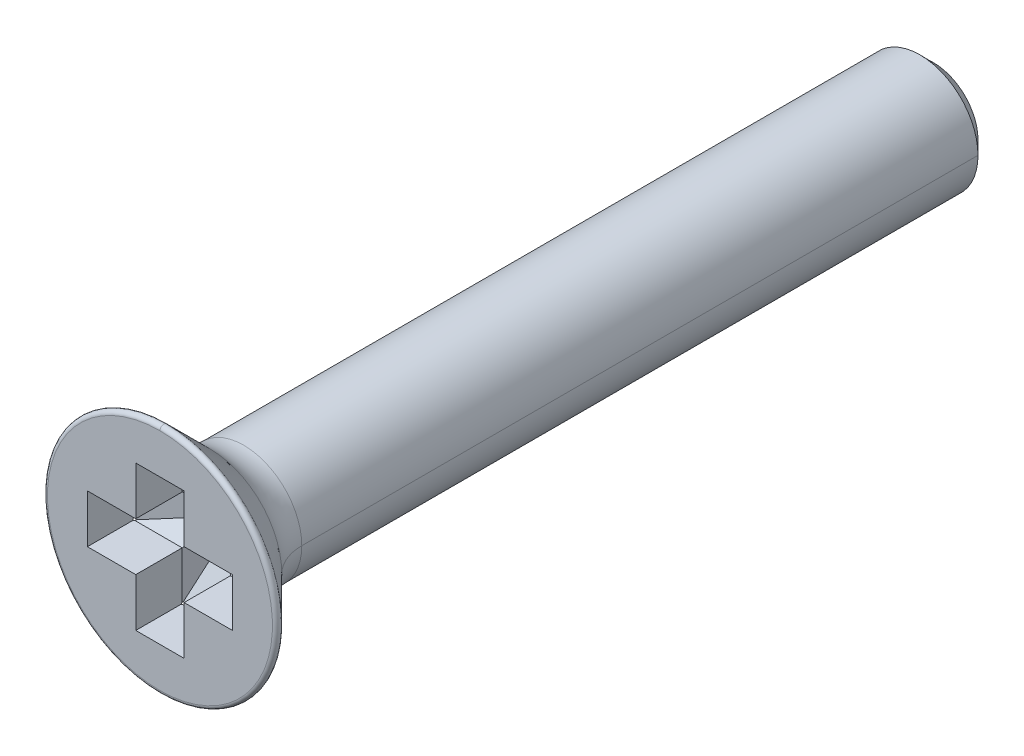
ISO-10303-21;
HEADER;
FILE_DESCRIPTION(('STEP AP214'),'2;1');
FILE_NAME('part.step','',(''),(''),'','','');
FILE_SCHEMA(('AUTOMOTIVE_DESIGN { 1 0 10303 214 1 1 1 1 }'));
ENDSEC;
DATA;
#1=APPLICATION_CONTEXT('core data for automotive mechanical design processes');
#2=APPLICATION_PROTOCOL_DEFINITION('international standard','automotive_design',2000,#1);
#3=PRODUCT_CONTEXT('',#1,'mechanical');
#4=PRODUCT('Part','Part','',(#3));
#5=PRODUCT_RELATED_PRODUCT_CATEGORY('part','',(#4));
#6=PRODUCT_DEFINITION_FORMATION('','',#4);
#7=PRODUCT_DEFINITION_CONTEXT('part definition',#1,'design');
#8=PRODUCT_DEFINITION('design','',#6,#7);
#9=PRODUCT_DEFINITION_SHAPE('','',#8);
#10=(LENGTH_UNIT() NAMED_UNIT(*) SI_UNIT(.MILLI.,.METRE.));
#11=(NAMED_UNIT(*) PLANE_ANGLE_UNIT() SI_UNIT($,.RADIAN.));
#12=(NAMED_UNIT(*) SI_UNIT($,.STERADIAN.) SOLID_ANGLE_UNIT());
#13=UNCERTAINTY_MEASURE_WITH_UNIT(LENGTH_MEASURE(1.E-05),#10,'distance_accuracy_value','');
#14=(GEOMETRIC_REPRESENTATION_CONTEXT(3) GLOBAL_UNCERTAINTY_ASSIGNED_CONTEXT((#13)) GLOBAL_UNIT_ASSIGNED_CONTEXT((#10,
#11,#12)) REPRESENTATION_CONTEXT('',''));
#15=CARTESIAN_POINT('',(0.,0.,0.));
#16=DIRECTION('',(0.,0.,1.));
#17=DIRECTION('',(1.,0.,0.));
#18=AXIS2_PLACEMENT_3D('',#15,#16,#17);
#19=CARTESIAN_POINT('',(0.,0.,0.));
#20=DIRECTION('',(0.,0.,1.));
#21=DIRECTION('',(1.,0.,0.));
#22=AXIS2_PLACEMENT_3D('',#19,#20,#21);
#23=CYLINDRICAL_SURFACE('',#22,1.5);
#24=DIRECTION('',(1.97516457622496E-07,-9.48175763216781E-12,0.999999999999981));
#25=VECTOR('',#24,1.);
#26=CARTESIAN_POINT('',(1.499996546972,1.591464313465E-10,0.350003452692));
#27=LINE('',#26,#25);
#28=CARTESIAN_POINT('',(1.5,0.,0.3500013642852));
#29=VERTEX_POINT('',#28);
#30=CARTESIAN_POINT('',(1.5,0.,17.83223304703));
#31=VERTEX_POINT('',#30);
#32=EDGE_CURVE('E359',#29,#31,#27,.T.);
#33=ORIENTED_EDGE('',*,*,#32,.F.);
#34=CARTESIAN_POINT('',(0.,0.,0.3500013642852));
#35=DIRECTION('',(0.,0.,-1.));
#36=DIRECTION('',(-1.,0.,0.));
#37=AXIS2_PLACEMENT_3D('',#34,#35,#36);
#38=CIRCLE('',#37,1.5);
#39=CARTESIAN_POINT('',(-1.5,0.,0.3500013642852));
#40=VERTEX_POINT('',#39);
#41=EDGE_CURVE('E557',#40,#29,#38,.T.);
#42=ORIENTED_EDGE('',*,*,#41,.F.);
#43=DIRECTION('',(-1.97516457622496E-07,9.35560645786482E-12,0.999999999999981));
#44=VECTOR('',#43,1.);
#45=CARTESIAN_POINT('',(-1.499996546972,-1.591461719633E-10,0.350003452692));
#46=LINE('',#45,#44);
#47=CARTESIAN_POINT('',(-1.5,0.,17.83223304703));
#48=VERTEX_POINT('',#47);
#49=EDGE_CURVE('E366',#40,#48,#46,.T.);
#50=ORIENTED_EDGE('',*,*,#49,.T.);
#51=CARTESIAN_POINT('',(0.,0.,17.83223304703));
#52=DIRECTION('',(0.,0.,-1.));
#53=DIRECTION('',(-1.,0.,0.));
#54=AXIS2_PLACEMENT_3D('',#51,#52,#53);
#55=CIRCLE('',#54,1.5);
#56=EDGE_CURVE('E345',#48,#31,#55,.T.);
#57=ORIENTED_EDGE('',*,*,#56,.T.);
#58=EDGE_LOOP('',(#33,#42,#50,#57));
#59=FACE_BOUND('',#58,.T.);
#60=ADVANCED_FACE('F16',(#59),#23,.T.);
#61=CARTESIAN_POINT('',(0.,0.,17.83223304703));
#62=DIRECTION('',(0.,0.,1.));
#63=DIRECTION('',(-0.0205680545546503,-0.999788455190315,0.));
#64=AXIS2_PLACEMENT_3D('',#61,#62,#63);
#65=TOROIDAL_SURFACE('',#64,2.75,1.25);
#66=CARTESIAN_POINT('',(2.75,-4.218793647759E-10,17.83223304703));
#67=DIRECTION('',(1.534106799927E-10,1.,0.));
#68=DIRECTION('',(-1.,1.534106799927E-10,0.));
#69=AXIS2_PLACEMENT_3D('',#66,#67,#68);
#70=CIRCLE('',#69,1.25);
#71=CARTESIAN_POINT('',(1.866116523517,0.,18.71611652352));
#72=VERTEX_POINT('',#71);
#73=EDGE_CURVE('E474',#31,#72,#70,.T.);
#74=ORIENTED_EDGE('',*,*,#73,.T.);
#75=CARTESIAN_POINT('',(0.,0.,18.71611652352));
#76=DIRECTION('',(0.,0.,1.));
#77=DIRECTION('',(0.,-1.,0.));
#78=AXIS2_PLACEMENT_3D('',#75,#76,#77);
#79=CIRCLE('',#78,1.866116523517);
#80=CARTESIAN_POINT('',(0.,-1.866116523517,18.71611652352));
#81=VERTEX_POINT('',#80);
#82=EDGE_CURVE('E339',#81,#72,#79,.T.);
#83=ORIENTED_EDGE('',*,*,#82,.F.);
#84=CARTESIAN_POINT('',(-3.515429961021E-10,-2.75,17.83223304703));
#85=DIRECTION('',(1.,-1.27833816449E-10,0.));
#86=DIRECTION('',(1.27833816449E-10,1.,0.));
#87=AXIS2_PLACEMENT_3D('',#84,#85,#86);
#88=CIRCLE('',#87,1.25);
#89=CARTESIAN_POINT('',(0.,-1.5,17.83223304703));
#90=VERTEX_POINT('',#89);
#91=EDGE_CURVE('E332',#90,#81,#88,.T.);
#92=ORIENTED_EDGE('',*,*,#91,.F.);
#93=CARTESIAN_POINT('',(0.,0.,17.83223304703));
#94=DIRECTION('',(0.,0.,1.));
#95=DIRECTION('',(0.,-1.,0.));
#96=AXIS2_PLACEMENT_3D('',#93,#94,#95);
#97=CIRCLE('',#96,1.5);
#98=EDGE_CURVE('E337',#90,#31,#97,.T.);
#99=ORIENTED_EDGE('',*,*,#98,.T.);
#100=EDGE_LOOP('',(#74,#83,#92,#99));
#101=FACE_BOUND('',#100,.T.);
#102=ADVANCED_FACE('F335',(#101),#65,.F.);
#103=CARTESIAN_POINT('',(0.,0.,19.9));
#104=DIRECTION('',(0.,0.,-1.));
#105=DIRECTION('',(0.0190670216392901,0.999818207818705,0.));
#106=AXIS2_PLACEMENT_3D('',#103,#104,#105);
#107=TOROIDAL_SURFACE('',#106,2.908578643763,0.1);
#108=CARTESIAN_POINT('',(0.,2.908578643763,19.9));
#109=DIRECTION('',(-1.,0.,0.));
#110=DIRECTION('',(0.,0.,1.));
#111=AXIS2_PLACEMENT_3D('',#108,#109,#110);
#112=CIRCLE('',#111,0.1);
#113=CARTESIAN_POINT('',(0.,2.908578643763,20.));
#114=VERTEX_POINT('',#113);
#115=CARTESIAN_POINT('',(0.,2.979289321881,19.82928932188));
#116=VERTEX_POINT('',#115);
#117=EDGE_CURVE('E10',#114,#116,#112,.T.);
#118=ORIENTED_EDGE('',*,*,#117,.T.);
#119=CARTESIAN_POINT('',(0.,0.,19.82928932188));
#120=DIRECTION('',(0.,0.,1.));
#121=DIRECTION('',(0.,1.,0.));
#122=AXIS2_PLACEMENT_3D('',#119,#120,#121);
#123=CIRCLE('',#122,2.979289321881);
#124=CARTESIAN_POINT('',(0.,-2.979289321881,19.82928932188));
#125=VERTEX_POINT('',#124);
#126=EDGE_CURVE('E429',#116,#125,#123,.T.);
#127=ORIENTED_EDGE('',*,*,#126,.T.);
#128=CARTESIAN_POINT('',(0.,-2.908578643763,19.9));
#129=DIRECTION('',(1.,0.,0.));
#130=DIRECTION('',(0.,0.,1.));
#131=AXIS2_PLACEMENT_3D('',#128,#129,#130);
#132=CIRCLE('',#131,0.1);
#133=CARTESIAN_POINT('',(0.,-2.908578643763,20.));
#134=VERTEX_POINT('',#133);
#135=EDGE_CURVE('E29',#134,#125,#132,.T.);
#136=ORIENTED_EDGE('',*,*,#135,.F.);
#137=CARTESIAN_POINT('',(0.,0.,20.));
#138=DIRECTION('',(0.,0.,1.));
#139=DIRECTION('',(0.,1.,0.));
#140=AXIS2_PLACEMENT_3D('',#137,#138,#139);
#141=CIRCLE('',#140,2.908578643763);
#142=EDGE_CURVE('E461',#114,#134,#141,.T.);
#143=ORIENTED_EDGE('',*,*,#142,.F.);
#144=EDGE_LOOP('',(#118,#127,#136,#143));
#145=FACE_BOUND('',#144,.T.);
#146=ADVANCED_FACE('F967',(#145),#107,.T.);
#147=CARTESIAN_POINT('',(0.,0.,19.9));
#148=DIRECTION('',(0.,0.,-1.));
#149=DIRECTION('',(-0.0190670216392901,-0.999818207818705,0.));
#150=AXIS2_PLACEMENT_3D('',#147,#148,#149);
#151=TOROIDAL_SURFACE('',#150,2.908578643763,0.1);
#152=ORIENTED_EDGE('',*,*,#135,.T.);
#153=CARTESIAN_POINT('',(0.,0.,19.82928932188));
#154=DIRECTION('',(0.,0.,1.));
#155=DIRECTION('',(0.,-1.,0.));
#156=AXIS2_PLACEMENT_3D('',#153,#154,#155);
#157=CIRCLE('',#156,2.979289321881);
#158=EDGE_CURVE('E447',#125,#116,#157,.T.);
#159=ORIENTED_EDGE('',*,*,#158,.T.);
#160=ORIENTED_EDGE('',*,*,#117,.F.);
#161=CARTESIAN_POINT('',(0.,0.,20.));
#162=DIRECTION('',(0.,0.,1.));
#163=DIRECTION('',(0.,-1.,0.));
#164=AXIS2_PLACEMENT_3D('',#161,#162,#163);
#165=CIRCLE('',#164,2.908578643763);
#166=EDGE_CURVE('E386',#134,#114,#165,.T.);
#167=ORIENTED_EDGE('',*,*,#166,.F.);
#168=EDGE_LOOP('',(#152,#159,#160,#167));
#169=FACE_BOUND('',#168,.T.);
#170=ADVANCED_FACE('F971',(#169),#151,.T.);
#171=CARTESIAN_POINT('',(-1.875,-0.625,20.));
#172=DIRECTION('',(0.,-1.,0.));
#173=DIRECTION('',(0.,0.,-1.));
#174=AXIS2_PLACEMENT_3D('',#171,#172,#173);
#175=PLANE('',#174);
#176=CARTESIAN_POINT('',(-1.847126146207,-0.625,18.8));
#177=CARTESIAN_POINT('',(-1.85175665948,-0.625,18.80438622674));
#178=CARTESIAN_POINT('',(-1.861032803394,-0.625,18.81317638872));
#179=CARTESIAN_POINT('',(-1.870339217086,-0.625,18.8220019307));
#180=CARTESIAN_POINT('',(-1.875,-0.625,18.82642353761));
#181=(BOUNDED_CURVE() B_SPLINE_CURVE(3,(#176,#177,#178,#179,#180),.UNSPECIFIED.,.F.,
.F.) B_SPLINE_CURVE_WITH_KNOTS((4,1,4),(0.,0.5,1.),
.UNSPECIFIED.) CURVE() GEOMETRIC_REPRESENTATION_ITEM() RATIONAL_B_SPLINE_CURVE((1.,1.,1.,1.,1.)) REPRESENTATION_ITEM(''));
#182=CARTESIAN_POINT('',(-1.847126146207,-0.625,18.8));
#183=VERTEX_POINT('',#182);
#184=CARTESIAN_POINT('',(-1.875,-0.625,18.82642353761));
#185=VERTEX_POINT('',#184);
#186=EDGE_CURVE('E580',#183,#185,#181,.T.);
#187=ORIENTED_EDGE('',*,*,#186,.T.);
#188=DIRECTION('',(0.,0.,-1.));
#189=VECTOR('',#188,1.);
#190=CARTESIAN_POINT('',(-1.875,-0.625,20.));
#191=LINE('',#190,#189);
#192=CARTESIAN_POINT('',(-1.875,-0.625,20.));
#193=VERTEX_POINT('',#192);
#194=EDGE_CURVE('E691',#193,#185,#191,.T.);
#195=ORIENTED_EDGE('',*,*,#194,.F.);
#196=DIRECTION('',(1.,0.,0.));
#197=VECTOR('',#196,1.);
#198=CARTESIAN_POINT('',(-1.875,-0.625,20.));
#199=LINE('',#198,#197);
#200=CARTESIAN_POINT('',(-0.625,-0.625,20.));
#201=VERTEX_POINT('',#200);
#202=EDGE_CURVE('E383',#193,#201,#199,.T.);
#203=ORIENTED_EDGE('',*,*,#202,.T.);
#204=DIRECTION('',(0.,0.,-1.));
#205=VECTOR('',#204,1.);
#206=CARTESIAN_POINT('',(-0.625,-0.625,20.));
#207=LINE('',#206,#205);
#208=CARTESIAN_POINT('',(-0.625,-0.625,18.8));
#209=VERTEX_POINT('',#208);
#210=EDGE_CURVE('E466',#201,#209,#207,.T.);
#211=ORIENTED_EDGE('',*,*,#210,.T.);
#212=DIRECTION('',(1.,0.,0.));
#213=VECTOR('',#212,1.);
#214=CARTESIAN_POINT('',(-1.847126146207,-0.625,18.8));
#215=LINE('',#214,#213);
#216=EDGE_CURVE('E435',#183,#209,#215,.T.);
#217=ORIENTED_EDGE('',*,*,#216,.F.);
#218=EDGE_LOOP('',(#187,#195,#203,#211,#217));
#219=FACE_BOUND('',#218,.T.);
#220=ADVANCED_FACE('F1064',(#219),#175,.F.);
#221=CARTESIAN_POINT('',(-0.6416666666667,-0.3208333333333,18.4));
#222=DIRECTION('',(0.,-0.796002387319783,-0.605293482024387));
#223=DIRECTION('',(0.,0.605293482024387,-0.796002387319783));
#224=AXIS2_PLACEMENT_3D('',#221,#222,#223);
#225=PLANE('',#224);
#226=DIRECTION('',(-0.517821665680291,-0.517821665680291,0.680970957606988));
#227=VECTOR('',#226,1.);
#228=CARTESIAN_POINT('',(-0.01666666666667,-0.01666666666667,18.));
#229=LINE('',#228,#227);
#230=CARTESIAN_POINT('',(-0.01666666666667,-0.01666666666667,18.));
#231=VERTEX_POINT('',#230);
#232=EDGE_CURVE('E698',#231,#209,#229,.T.);
#233=ORIENTED_EDGE('',*,*,#232,.F.);
#234=DIRECTION('',(1.,0.,0.));
#235=VECTOR('',#234,1.);
#236=CARTESIAN_POINT('',(-0.05,-0.01666666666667,18.));
#237=LINE('',#236,#235);
#238=CARTESIAN_POINT('',(-0.05,-0.01666666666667,18.));
#239=VERTEX_POINT('',#238);
#240=EDGE_CURVE('E861',#239,#231,#237,.T.);
#241=ORIENTED_EDGE('',*,*,#240,.F.);
#242=DIRECTION('',(-0.875957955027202,-0.291985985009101,0.383981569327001));
#243=VECTOR('',#242,1.);
#244=CARTESIAN_POINT('',(-0.05,-0.01666666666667,18.));
#245=LINE('',#244,#243);
#246=CARTESIAN_POINT('',(-1.832086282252,-0.6106954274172,18.78118850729));
#247=VERTEX_POINT('',#246);
#248=EDGE_CURVE('E652',#239,#247,#245,.T.);
#249=ORIENTED_EDGE('',*,*,#248,.T.);
#250=CARTESIAN_POINT('',(-1.847126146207,-0.625,18.8));
#251=CARTESIAN_POINT('',(-1.844615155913,-0.6226084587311,18.79685495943));
#252=CARTESIAN_POINT('',(-1.839597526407,-0.6178328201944,18.79057466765));
#253=CARTESIAN_POINT('',(-1.834588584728,-0.6130720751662,18.78431396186));
#254=CARTESIAN_POINT('',(-1.832086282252,-0.6106954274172,18.78118850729));
#255=(BOUNDED_CURVE() B_SPLINE_CURVE(3,(#250,#251,#252,#253,#254),.UNSPECIFIED.,.F.,
.F.) B_SPLINE_CURVE_WITH_KNOTS((4,1,4),(0.,0.5,1.),
.UNSPECIFIED.) CURVE() GEOMETRIC_REPRESENTATION_ITEM() RATIONAL_B_SPLINE_CURVE((1.,1.,1.,1.,1.)) REPRESENTATION_ITEM(''));
#256=EDGE_CURVE('E592',#183,#247,#255,.T.);
#257=ORIENTED_EDGE('',*,*,#256,.F.);
#258=ORIENTED_EDGE('',*,*,#216,.T.);
#259=EDGE_LOOP('',(#233,#241,#249,#257,#258));
#260=FACE_BOUND('',#259,.T.);
#261=ADVANCED_FACE('F1062',(#260),#225,.F.);
#262=CARTESIAN_POINT('',(-0.9625,0.,18.4));
#263=DIRECTION('',(-0.40147688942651,0.,-0.915869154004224));
#264=DIRECTION('',(-0.915869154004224,0.,0.40147688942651));
#265=AXIS2_PLACEMENT_3D('',#262,#263,#264);
#266=PLANE('',#265);
#267=CARTESIAN_POINT('',(-1.832086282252,-0.6106954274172,18.78118850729));
#268=CARTESIAN_POINT('',(-1.847238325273,-0.5862431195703,18.78783049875));
#269=CARTESIAN_POINT('',(-1.861552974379,-0.5612205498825,18.79410541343));
#270=CARTESIAN_POINT('',(-1.875,-0.5356071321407,18.8));
#271=(BOUNDED_CURVE() B_SPLINE_CURVE(3,(#267,#268,#269,#270),.UNSPECIFIED.,.F.,
.F.) B_SPLINE_CURVE_WITH_KNOTS((4,4),(0.,1.),
.UNSPECIFIED.) CURVE() GEOMETRIC_REPRESENTATION_ITEM() RATIONAL_B_SPLINE_CURVE((1.,1.,1.,1.)) REPRESENTATION_ITEM(''));
#272=CARTESIAN_POINT('',(-1.875,-0.5356071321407,18.8));
#273=VERTEX_POINT('',#272);
#274=EDGE_CURVE('E623',#247,#273,#271,.T.);
#275=ORIENTED_EDGE('',*,*,#274,.F.);
#276=ORIENTED_EDGE('',*,*,#248,.F.);
#277=DIRECTION('',(0.,-1.,0.));
#278=VECTOR('',#277,1.);
#279=CARTESIAN_POINT('',(-0.05,0.01666666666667,18.));
#280=LINE('',#279,#278);
#281=CARTESIAN_POINT('',(-0.05,0.01666666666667,18.));
#282=VERTEX_POINT('',#281);
#283=EDGE_CURVE('E670',#282,#239,#280,.T.);
#284=ORIENTED_EDGE('',*,*,#283,.F.);
#285=DIRECTION('',(-0.875957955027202,0.291985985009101,0.383981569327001));
#286=VECTOR('',#285,1.);
#287=CARTESIAN_POINT('',(-0.05,0.01666666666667,18.));
#288=LINE('',#287,#286);
#289=CARTESIAN_POINT('',(-1.832086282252,0.6106954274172,18.78118850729));
#290=VERTEX_POINT('',#289);
#291=EDGE_CURVE('E390',#282,#290,#288,.T.);
#292=ORIENTED_EDGE('',*,*,#291,.T.);
#293=CARTESIAN_POINT('',(-1.875,0.5356071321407,18.8));
#294=CARTESIAN_POINT('',(-1.861552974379,0.5612205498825,18.79410541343));
#295=CARTESIAN_POINT('',(-1.847238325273,0.5862431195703,18.78783049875));
#296=CARTESIAN_POINT('',(-1.832086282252,0.6106954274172,18.78118850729));
#297=(BOUNDED_CURVE() B_SPLINE_CURVE(3,(#293,#294,#295,#296),.UNSPECIFIED.,.F.,
.F.) B_SPLINE_CURVE_WITH_KNOTS((4,4),(0.,1.),
.UNSPECIFIED.) CURVE() GEOMETRIC_REPRESENTATION_ITEM() RATIONAL_B_SPLINE_CURVE((1.,1.,1.,1.)) REPRESENTATION_ITEM(''));
#298=CARTESIAN_POINT('',(-1.875,0.5356071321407,18.8));
#299=VERTEX_POINT('',#298);
#300=EDGE_CURVE('E524',#299,#290,#297,.T.);
#301=ORIENTED_EDGE('',*,*,#300,.F.);
#302=DIRECTION('',(0.,-1.,0.));
#303=VECTOR('',#302,1.);
#304=CARTESIAN_POINT('',(-1.875,0.5356071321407,18.8));
#305=LINE('',#304,#303);
#306=EDGE_CURVE('E688',#299,#273,#305,.T.);
#307=ORIENTED_EDGE('',*,*,#306,.T.);
#308=EDGE_LOOP('',(#275,#276,#284,#292,#301,#307));
#309=FACE_BOUND('',#308,.T.);
#310=ADVANCED_FACE('F1059',(#309),#266,.F.);
#311=CARTESIAN_POINT('',(-1.875,0.625,20.));
#312=DIRECTION('',(-1.,0.,0.));
#313=DIRECTION('',(0.,0.,1.));
#314=AXIS2_PLACEMENT_3D('',#311,#312,#313);
#315=PLANE('',#314);
#316=CARTESIAN_POINT('',(-1.875,0.5356071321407,18.8));
#317=CARTESIAN_POINT('',(-1.875,0.5503354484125,18.8040454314));
#318=CARTESIAN_POINT('',(-1.875,0.5799633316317,18.81249193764));
#319=CARTESIAN_POINT('',(-1.875,0.6099314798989,18.82165845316));
#320=CARTESIAN_POINT('',(-1.875,0.625,18.82642353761));
#321=(BOUNDED_CURVE() B_SPLINE_CURVE(3,(#316,#317,#318,#319,#320),.UNSPECIFIED.,.F.,
.F.) B_SPLINE_CURVE_WITH_KNOTS((4,1,4),(0.,0.5,1.),
.UNSPECIFIED.) CURVE() GEOMETRIC_REPRESENTATION_ITEM() RATIONAL_B_SPLINE_CURVE((1.,1.,1.,1.,1.)) REPRESENTATION_ITEM(''));
#322=CARTESIAN_POINT('',(-1.875,0.625,18.82642353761));
#323=VERTEX_POINT('',#322);
#324=EDGE_CURVE('E515',#299,#323,#321,.T.);
#325=ORIENTED_EDGE('',*,*,#324,.T.);
#326=DIRECTION('',(0.,0.,-1.));
#327=VECTOR('',#326,1.);
#328=CARTESIAN_POINT('',(-1.875,0.625,20.));
#329=LINE('',#328,#327);
#330=CARTESIAN_POINT('',(-1.875,0.625,20.));
#331=VERTEX_POINT('',#330);
#332=EDGE_CURVE('E389',#331,#323,#329,.T.);
#333=ORIENTED_EDGE('',*,*,#332,.F.);
#334=DIRECTION('',(0.,-1.,0.));
#335=VECTOR('',#334,1.);
#336=CARTESIAN_POINT('',(-1.875,0.625,20.));
#337=LINE('',#336,#335);
#338=EDGE_CURVE('E370',#331,#193,#337,.T.);
#339=ORIENTED_EDGE('',*,*,#338,.T.);
#340=ORIENTED_EDGE('',*,*,#194,.T.);
#341=CARTESIAN_POINT('',(-1.875,-0.625,18.82642353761));
#342=CARTESIAN_POINT('',(-1.875,-0.6099343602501,18.821659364));
#343=CARTESIAN_POINT('',(-1.875,-0.5799691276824,18.81249365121));
#344=CARTESIAN_POINT('',(-1.875,-0.5503383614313,18.80404623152));
#345=CARTESIAN_POINT('',(-1.875,-0.5356071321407,18.8));
#346=(BOUNDED_CURVE() B_SPLINE_CURVE(3,(#341,#342,#343,#344,#345),.UNSPECIFIED.,.F.,
.F.) B_SPLINE_CURVE_WITH_KNOTS((4,1,4),(0.,0.5,1.),
.UNSPECIFIED.) CURVE() GEOMETRIC_REPRESENTATION_ITEM() RATIONAL_B_SPLINE_CURVE((1.,1.,1.,1.,1.)) REPRESENTATION_ITEM(''));
#347=EDGE_CURVE('E574',#185,#273,#346,.T.);
#348=ORIENTED_EDGE('',*,*,#347,.T.);
#349=ORIENTED_EDGE('',*,*,#306,.F.);
#350=EDGE_LOOP('',(#325,#333,#339,#340,#348,#349));
#351=FACE_BOUND('',#350,.T.);
#352=ADVANCED_FACE('F18',(#351),#315,.F.);
#353=CARTESIAN_POINT('',(-0.625,0.625,20.));
#354=DIRECTION('',(0.,1.,0.));
#355=DIRECTION('',(1.,0.,0.));
#356=AXIS2_PLACEMENT_3D('',#353,#354,#355);
#357=PLANE('',#356);
#358=DIRECTION('',(0.,0.,-1.));
#359=VECTOR('',#358,1.);
#360=CARTESIAN_POINT('',(-0.625,0.625,20.));
#361=LINE('',#360,#359);
#362=CARTESIAN_POINT('',(-0.625,0.625,20.));
#363=VERTEX_POINT('',#362);
#364=CARTESIAN_POINT('',(-0.625,0.625,18.8));
#365=VERTEX_POINT('',#364);
#366=EDGE_CURVE('E416',#363,#365,#361,.T.);
#367=ORIENTED_EDGE('',*,*,#366,.F.);
#368=DIRECTION('',(-1.,0.,0.));
#369=VECTOR('',#368,1.);
#370=CARTESIAN_POINT('',(-0.625,0.625,20.));
#371=LINE('',#370,#369);
#372=EDGE_CURVE('E661',#363,#331,#371,.T.);
#373=ORIENTED_EDGE('',*,*,#372,.T.);
#374=ORIENTED_EDGE('',*,*,#332,.T.);
#375=CARTESIAN_POINT('',(-1.875,0.625,18.82642353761));
#376=CARTESIAN_POINT('',(-1.870340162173,0.625,18.82200282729));
#377=CARTESIAN_POINT('',(-1.861034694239,0.625,18.81317818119));
#378=CARTESIAN_POINT('',(-1.851757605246,0.625,18.80438712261));
#379=CARTESIAN_POINT('',(-1.847126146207,0.625,18.8));
#380=(BOUNDED_CURVE() B_SPLINE_CURVE(3,(#375,#376,#377,#378,#379),.UNSPECIFIED.,.F.,
.F.) B_SPLINE_CURVE_WITH_KNOTS((4,1,4),(0.,0.5,1.),
.UNSPECIFIED.) CURVE() GEOMETRIC_REPRESENTATION_ITEM() RATIONAL_B_SPLINE_CURVE((1.,1.,1.,1.,1.)) REPRESENTATION_ITEM(''));
#381=CARTESIAN_POINT('',(-1.847126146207,0.625,18.8));
#382=VERTEX_POINT('',#381);
#383=EDGE_CURVE('E525',#323,#382,#380,.T.);
#384=ORIENTED_EDGE('',*,*,#383,.T.);
#385=DIRECTION('',(1.,0.,0.));
#386=VECTOR('',#385,1.);
#387=CARTESIAN_POINT('',(-1.847126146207,0.625,18.8));
#388=LINE('',#387,#386);
#389=EDGE_CURVE('E42',#382,#365,#388,.T.);
#390=ORIENTED_EDGE('',*,*,#389,.T.);
#391=EDGE_LOOP('',(#367,#373,#374,#384,#390));
#392=FACE_BOUND('',#391,.T.);
#393=ADVANCED_FACE('F1009',(#392),#357,.F.);
#394=CARTESIAN_POINT('',(-0.6416666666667,0.3208333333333,18.4));
#395=DIRECTION('',(0.,0.796002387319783,-0.605293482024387));
#396=DIRECTION('',(-1.,0.,0.));
#397=AXIS2_PLACEMENT_3D('',#394,#395,#396);
#398=PLANE('',#397);
#399=CARTESIAN_POINT('',(-1.832086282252,0.6106954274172,18.78118850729));
#400=CARTESIAN_POINT('',(-1.834588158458,0.613071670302,18.78431342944));
#401=CARTESIAN_POINT('',(-1.839596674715,0.6178320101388,18.79057360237));
#402=CARTESIAN_POINT('',(-1.844614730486,0.6226080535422,18.79685442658));
#403=CARTESIAN_POINT('',(-1.847126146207,0.625,18.8));
#404=(BOUNDED_CURVE() B_SPLINE_CURVE(3,(#399,#400,#401,#402,#403),.UNSPECIFIED.,.F.,
.F.) B_SPLINE_CURVE_WITH_KNOTS((4,1,4),(0.,0.5,1.),
.UNSPECIFIED.) CURVE() GEOMETRIC_REPRESENTATION_ITEM() RATIONAL_B_SPLINE_CURVE((1.,1.,1.,1.,1.)) REPRESENTATION_ITEM(''));
#405=EDGE_CURVE('E581',#290,#382,#404,.T.);
#406=ORIENTED_EDGE('',*,*,#405,.F.);
#407=ORIENTED_EDGE('',*,*,#291,.F.);
#408=DIRECTION('',(-1.,0.,0.));
#409=VECTOR('',#408,1.);
#410=CARTESIAN_POINT('',(-0.01666666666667,0.01666666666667,18.));
#411=LINE('',#410,#409);
#412=CARTESIAN_POINT('',(-0.01666666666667,0.01666666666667,18.));
#413=VERTEX_POINT('',#412);
#414=EDGE_CURVE('E459',#413,#282,#411,.T.);
#415=ORIENTED_EDGE('',*,*,#414,.F.);
#416=DIRECTION('',(-0.517821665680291,0.517821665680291,0.680970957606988));
#417=VECTOR('',#416,1.);
#418=CARTESIAN_POINT('',(-0.01666666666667,0.01666666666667,18.));
#419=LINE('',#418,#417);
#420=EDGE_CURVE('E483',#413,#365,#419,.T.);
#421=ORIENTED_EDGE('',*,*,#420,.T.);
#422=ORIENTED_EDGE('',*,*,#389,.F.);
#423=EDGE_LOOP('',(#406,#407,#415,#421,#422));
#424=FACE_BOUND('',#423,.T.);
#425=ADVANCED_FACE('F1001',(#424),#398,.F.);
#426=CARTESIAN_POINT('',(-0.3208333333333,0.6416666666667,18.4));
#427=DIRECTION('',(-0.796002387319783,0.,-0.605293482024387));
#428=DIRECTION('',(-0.605293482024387,0.,0.796002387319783));
#429=AXIS2_PLACEMENT_3D('',#426,#427,#428);
#430=PLANE('',#429);
#431=ORIENTED_EDGE('',*,*,#420,.F.);
#432=DIRECTION('',(0.,-1.,0.));
#433=VECTOR('',#432,1.);
#434=CARTESIAN_POINT('',(-0.01666666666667,0.05,18.));
#435=LINE('',#434,#433);
#436=CARTESIAN_POINT('',(-0.01666666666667,0.05,18.));
#437=VERTEX_POINT('',#436);
#438=EDGE_CURVE('E455',#437,#413,#435,.T.);
#439=ORIENTED_EDGE('',*,*,#438,.F.);
#440=DIRECTION('',(-0.291985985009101,0.875957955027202,0.383981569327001));
#441=VECTOR('',#440,1.);
#442=CARTESIAN_POINT('',(-0.01666666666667,0.05,18.));
#443=LINE('',#442,#441);
#444=CARTESIAN_POINT('',(-0.6106954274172,1.832086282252,18.78118850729));
#445=VERTEX_POINT('',#444);
#446=EDGE_CURVE('E864',#437,#445,#443,.T.);
#447=ORIENTED_EDGE('',*,*,#446,.T.);
#448=CARTESIAN_POINT('',(-0.625,1.847126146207,18.8));
#449=CARTESIAN_POINT('',(-0.6226084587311,1.844615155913,18.79685495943));
#450=CARTESIAN_POINT('',(-0.6178328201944,1.839597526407,18.79057466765));
#451=CARTESIAN_POINT('',(-0.6130720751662,1.834588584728,18.78431396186));
#452=CARTESIAN_POINT('',(-0.6106954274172,1.832086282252,18.78118850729));
#453=(BOUNDED_CURVE() B_SPLINE_CURVE(3,(#448,#449,#450,#451,#452),.UNSPECIFIED.,.F.,
.F.) B_SPLINE_CURVE_WITH_KNOTS((4,1,4),(0.,0.5,1.),
.UNSPECIFIED.) CURVE() GEOMETRIC_REPRESENTATION_ITEM() RATIONAL_B_SPLINE_CURVE((1.,1.,1.,1.,1.)) REPRESENTATION_ITEM(''));
#454=CARTESIAN_POINT('',(-0.625,1.847126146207,18.8));
#455=VERTEX_POINT('',#454);
#456=EDGE_CURVE('E564',#455,#445,#453,.T.);
#457=ORIENTED_EDGE('',*,*,#456,.F.);
#458=DIRECTION('',(0.,-1.,0.));
#459=VECTOR('',#458,1.);
#460=CARTESIAN_POINT('',(-0.625,1.847126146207,18.8));
#461=LINE('',#460,#459);
#462=EDGE_CURVE('E420',#455,#365,#461,.T.);
#463=ORIENTED_EDGE('',*,*,#462,.T.);
#464=EDGE_LOOP('',(#431,#439,#447,#457,#463));
#465=FACE_BOUND('',#464,.T.);
#466=ADVANCED_FACE('F998',(#465),#430,.F.);
#467=CARTESIAN_POINT('',(-0.625,1.875,20.));
#468=DIRECTION('',(-1.,0.,0.));
#469=DIRECTION('',(0.,0.,1.));
#470=AXIS2_PLACEMENT_3D('',#467,#468,#469);
#471=PLANE('',#470);
#472=CARTESIAN_POINT('',(-0.625,1.847126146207,18.8));
#473=CARTESIAN_POINT('',(-0.625,1.85175665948,18.80438622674));
#474=CARTESIAN_POINT('',(-0.625,1.861032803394,18.81317638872));
#475=CARTESIAN_POINT('',(-0.625,1.870339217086,18.8220019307));
#476=CARTESIAN_POINT('',(-0.625,1.875,18.82642353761));
#477=(BOUNDED_CURVE() B_SPLINE_CURVE(3,(#472,#473,#474,#475,#476),.UNSPECIFIED.,.F.,
.F.) B_SPLINE_CURVE_WITH_KNOTS((4,1,4),(0.,0.5,1.),
.UNSPECIFIED.) CURVE() GEOMETRIC_REPRESENTATION_ITEM() RATIONAL_B_SPLINE_CURVE((1.,1.,1.,1.,1.)) REPRESENTATION_ITEM(''));
#478=CARTESIAN_POINT('',(-0.625,1.875,18.82642353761));
#479=VERTEX_POINT('',#478);
#480=EDGE_CURVE('E558',#455,#479,#477,.T.);
#481=ORIENTED_EDGE('',*,*,#480,.T.);
#482=DIRECTION('',(0.,0.,-1.));
#483=VECTOR('',#482,1.);
#484=CARTESIAN_POINT('',(-0.625,1.875,20.));
#485=LINE('',#484,#483);
#486=CARTESIAN_POINT('',(-0.625,1.875,20.));
#487=VERTEX_POINT('',#486);
#488=EDGE_CURVE('E421',#487,#479,#485,.T.);
#489=ORIENTED_EDGE('',*,*,#488,.F.);
#490=DIRECTION('',(0.,-1.,0.));
#491=VECTOR('',#490,1.);
#492=CARTESIAN_POINT('',(-0.625,1.875,20.));
#493=LINE('',#492,#491);
#494=EDGE_CURVE('E654',#487,#363,#493,.T.);
#495=ORIENTED_EDGE('',*,*,#494,.T.);
#496=ORIENTED_EDGE('',*,*,#366,.T.);
#497=ORIENTED_EDGE('',*,*,#462,.F.);
#498=EDGE_LOOP('',(#481,#489,#495,#496,#497));
#499=FACE_BOUND('',#498,.T.);
#500=ADVANCED_FACE('F997',(#499),#471,.F.);
#501=CARTESIAN_POINT('',(0.625,1.875,20.));
#502=DIRECTION('',(0.,1.,0.));
#503=DIRECTION('',(1.,0.,0.));
#504=AXIS2_PLACEMENT_3D('',#501,#502,#503);
#505=PLANE('',#504);
#506=CARTESIAN_POINT('',(0.5356071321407,1.875,18.8));
#507=CARTESIAN_POINT('',(0.5503660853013,1.875,18.80405384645));
#508=CARTESIAN_POINT('',(0.5800242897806,1.875,18.81250996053));
#509=CARTESIAN_POINT('',(0.6099617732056,1.875,18.82166803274));
#510=CARTESIAN_POINT('',(0.625,1.875,18.82642353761));
#511=(BOUNDED_CURVE() B_SPLINE_CURVE(3,(#506,#507,#508,#509,#510),.UNSPECIFIED.,.F.,
.F.) B_SPLINE_CURVE_WITH_KNOTS((4,1,4),(0.,0.5,1.),
.UNSPECIFIED.) CURVE() GEOMETRIC_REPRESENTATION_ITEM() RATIONAL_B_SPLINE_CURVE((1.,1.,1.,1.,1.)) REPRESENTATION_ITEM(''));
#512=CARTESIAN_POINT('',(0.5356071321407,1.875,18.8));
#513=VERTEX_POINT('',#512);
#514=CARTESIAN_POINT('',(0.625,1.875,18.82642353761));
#515=VERTEX_POINT('',#514);
#516=EDGE_CURVE('E20',#513,#515,#511,.T.);
#517=ORIENTED_EDGE('',*,*,#516,.T.);
#518=DIRECTION('',(0.,0.,-1.));
#519=VECTOR('',#518,1.);
#520=CARTESIAN_POINT('',(0.625,1.875,20.));
#521=LINE('',#520,#519);
#522=CARTESIAN_POINT('',(0.625,1.875,20.));
#523=VERTEX_POINT('',#522);
#524=EDGE_CURVE('E391',#523,#515,#521,.T.);
#525=ORIENTED_EDGE('',*,*,#524,.F.);
#526=DIRECTION('',(-1.,0.,0.));
#527=VECTOR('',#526,1.);
#528=CARTESIAN_POINT('',(0.625,1.875,20.));
#529=LINE('',#528,#527);
#530=EDGE_CURVE('E660',#523,#487,#529,.T.);
#531=ORIENTED_EDGE('',*,*,#530,.T.);
#532=ORIENTED_EDGE('',*,*,#488,.T.);
#533=CARTESIAN_POINT('',(-0.625,1.875,18.82642353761));
#534=CARTESIAN_POINT('',(-0.6099568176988,1.875,18.82166646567));
#535=CARTESIAN_POINT('',(-0.5800143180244,1.875,18.81250701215));
#536=CARTESIAN_POINT('',(-0.5503610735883,1.875,18.80405246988));
#537=CARTESIAN_POINT('',(-0.5356071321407,1.875,18.8));
#538=(BOUNDED_CURVE() B_SPLINE_CURVE(3,(#533,#534,#535,#536,#537),.UNSPECIFIED.,.F.,
.F.) B_SPLINE_CURVE_WITH_KNOTS((4,1,4),(0.,0.5,1.),
.UNSPECIFIED.) CURVE() GEOMETRIC_REPRESENTATION_ITEM() RATIONAL_B_SPLINE_CURVE((1.,1.,1.,1.,1.)) REPRESENTATION_ITEM(''));
#539=CARTESIAN_POINT('',(-0.5356071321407,1.875,18.8));
#540=VERTEX_POINT('',#539);
#541=EDGE_CURVE('E565',#479,#540,#538,.T.);
#542=ORIENTED_EDGE('',*,*,#541,.T.);
#543=DIRECTION('',(-1.,0.,0.));
#544=VECTOR('',#543,1.);
#545=CARTESIAN_POINT('',(0.5356071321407,1.875,18.8));
#546=LINE('',#545,#544);
#547=EDGE_CURVE('E708',#513,#540,#546,.T.);
#548=ORIENTED_EDGE('',*,*,#547,.F.);
#549=EDGE_LOOP('',(#517,#525,#531,#532,#542,#548));
#550=FACE_BOUND('',#549,.T.);
#551=ADVANCED_FACE('F993',(#550),#505,.F.);
#552=CARTESIAN_POINT('',(0.,0.9625,18.4));
#553=DIRECTION('',(0.,0.40147688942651,-0.915869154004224));
#554=DIRECTION('',(-1.,0.,0.));
#555=AXIS2_PLACEMENT_3D('',#552,#553,#554);
#556=PLANE('',#555);
#557=CARTESIAN_POINT('',(-0.6106954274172,1.832086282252,18.78118850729));
#558=CARTESIAN_POINT('',(-0.5862431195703,1.847238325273,18.78783049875));
#559=CARTESIAN_POINT('',(-0.5612205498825,1.861552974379,18.79410541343));
#560=CARTESIAN_POINT('',(-0.5356071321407,1.875,18.8));
#561=(BOUNDED_CURVE() B_SPLINE_CURVE(3,(#557,#558,#559,#560),.UNSPECIFIED.,.F.,
.F.) B_SPLINE_CURVE_WITH_KNOTS((4,4),(0.,1.),
.UNSPECIFIED.) CURVE() GEOMETRIC_REPRESENTATION_ITEM() RATIONAL_B_SPLINE_CURVE((1.,1.,1.,1.)) REPRESENTATION_ITEM(''));
#562=EDGE_CURVE('E716',#445,#540,#561,.T.);
#563=ORIENTED_EDGE('',*,*,#562,.F.);
#564=ORIENTED_EDGE('',*,*,#446,.F.);
#565=DIRECTION('',(-1.,0.,0.));
#566=VECTOR('',#565,1.);
#567=CARTESIAN_POINT('',(0.01666666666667,0.05,18.));
#568=LINE('',#567,#566);
#569=CARTESIAN_POINT('',(0.01666666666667,0.05,18.));
#570=VERTEX_POINT('',#569);
#571=EDGE_CURVE('E460',#570,#437,#568,.T.);
#572=ORIENTED_EDGE('',*,*,#571,.F.);
#573=DIRECTION('',(0.291985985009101,0.875957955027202,0.383981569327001));
#574=VECTOR('',#573,1.);
#575=CARTESIAN_POINT('',(0.01666666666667,0.05,18.));
#576=LINE('',#575,#574);
#577=CARTESIAN_POINT('',(0.6106954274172,1.832086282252,18.78118850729));
#578=VERTEX_POINT('',#577);
#579=EDGE_CURVE('E787',#570,#578,#576,.T.);
#580=ORIENTED_EDGE('',*,*,#579,.T.);
#581=CARTESIAN_POINT('',(0.5356071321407,1.875,18.8));
#582=CARTESIAN_POINT('',(0.5612205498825,1.861552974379,18.79410541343));
#583=CARTESIAN_POINT('',(0.5862431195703,1.847238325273,18.78783049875));
#584=CARTESIAN_POINT('',(0.6106954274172,1.832086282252,18.78118850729));
#585=(BOUNDED_CURVE() B_SPLINE_CURVE(3,(#581,#582,#583,#584),.UNSPECIFIED.,.F.,
.F.) B_SPLINE_CURVE_WITH_KNOTS((4,4),(0.,1.),
.UNSPECIFIED.) CURVE() GEOMETRIC_REPRESENTATION_ITEM() RATIONAL_B_SPLINE_CURVE((1.,1.,1.,1.)) REPRESENTATION_ITEM(''));
#586=EDGE_CURVE('E396',#513,#578,#585,.T.);
#587=ORIENTED_EDGE('',*,*,#586,.F.);
#588=ORIENTED_EDGE('',*,*,#547,.T.);
#589=EDGE_LOOP('',(#563,#564,#572,#580,#587,#588));
#590=FACE_BOUND('',#589,.T.);
#591=ADVANCED_FACE('F1050',(#590),#556,.F.);
#592=CARTESIAN_POINT('',(0.3208333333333,0.6416666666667,18.4));
#593=DIRECTION('',(0.796002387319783,0.,-0.605293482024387));
#594=DIRECTION('',(0.,-1.,0.));
#595=AXIS2_PLACEMENT_3D('',#592,#593,#594);
#596=PLANE('',#595);
#597=CARTESIAN_POINT('',(0.6106954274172,1.832086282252,18.78118850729));
#598=CARTESIAN_POINT('',(0.613071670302,1.834588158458,18.78431342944));
#599=CARTESIAN_POINT('',(0.6178320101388,1.839596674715,18.79057360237));
#600=CARTESIAN_POINT('',(0.6226080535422,1.844614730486,18.79685442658));
#601=CARTESIAN_POINT('',(0.625,1.847126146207,18.8));
#602=(BOUNDED_CURVE() B_SPLINE_CURVE(3,(#597,#598,#599,#600,#601),.UNSPECIFIED.,.F.,
.F.) B_SPLINE_CURVE_WITH_KNOTS((4,1,4),(0.,0.5,1.),
.UNSPECIFIED.) CURVE() GEOMETRIC_REPRESENTATION_ITEM() RATIONAL_B_SPLINE_CURVE((1.,1.,1.,1.,1.)) REPRESENTATION_ITEM(''));
#603=CARTESIAN_POINT('',(0.625,1.847126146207,18.8));
#604=VERTEX_POINT('',#603);
#605=EDGE_CURVE('E402',#578,#604,#602,.T.);
#606=ORIENTED_EDGE('',*,*,#605,.F.);
#607=ORIENTED_EDGE('',*,*,#579,.F.);
#608=DIRECTION('',(0.,1.,0.));
#609=VECTOR('',#608,1.);
#610=CARTESIAN_POINT('',(0.01666666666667,0.01666666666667,18.));
#611=LINE('',#610,#609);
#612=CARTESIAN_POINT('',(0.01666666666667,0.01666666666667,18.));
#613=VERTEX_POINT('',#612);
#614=EDGE_CURVE('E610',#613,#570,#611,.T.);
#615=ORIENTED_EDGE('',*,*,#614,.F.);
#616=DIRECTION('',(0.517821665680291,0.517821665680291,0.680970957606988));
#617=VECTOR('',#616,1.);
#618=CARTESIAN_POINT('',(0.01666666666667,0.01666666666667,18.));
#619=LINE('',#618,#617);
#620=CARTESIAN_POINT('',(0.625,0.625,18.8));
#621=VERTEX_POINT('',#620);
#622=EDGE_CURVE('E415',#613,#621,#619,.T.);
#623=ORIENTED_EDGE('',*,*,#622,.T.);
#624=DIRECTION('',(0.,-1.,0.));
#625=VECTOR('',#624,1.);
#626=CARTESIAN_POINT('',(0.625,1.847126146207,18.8));
#627=LINE('',#626,#625);
#628=EDGE_CURVE('E394',#604,#621,#627,.T.);
#629=ORIENTED_EDGE('',*,*,#628,.F.);
#630=EDGE_LOOP('',(#606,#607,#615,#623,#629));
#631=FACE_BOUND('',#630,.T.);
#632=ADVANCED_FACE('F1052',(#631),#596,.F.);
#633=CARTESIAN_POINT('',(0.625,0.625,20.));
#634=DIRECTION('',(1.,0.,0.));
#635=DIRECTION('',(0.,1.,0.));
#636=AXIS2_PLACEMENT_3D('',#633,#634,#635);
#637=PLANE('',#636);
#638=DIRECTION('',(0.,0.,-1.));
#639=VECTOR('',#638,1.);
#640=CARTESIAN_POINT('',(0.625,0.625,20.));
#641=LINE('',#640,#639);
#642=CARTESIAN_POINT('',(0.625,0.625,20.));
#643=VERTEX_POINT('',#642);
#644=EDGE_CURVE('E395',#643,#621,#641,.T.);
#645=ORIENTED_EDGE('',*,*,#644,.F.);
#646=DIRECTION('',(0.,1.,0.));
#647=VECTOR('',#646,1.);
#648=CARTESIAN_POINT('',(0.625,0.625,20.));
#649=LINE('',#648,#647);
#650=EDGE_CURVE('E741',#643,#523,#649,.T.);
#651=ORIENTED_EDGE('',*,*,#650,.T.);
#652=ORIENTED_EDGE('',*,*,#524,.T.);
#653=CARTESIAN_POINT('',(0.625,1.875,18.82642353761));
#654=CARTESIAN_POINT('',(0.625,1.870340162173,18.82200282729));
#655=CARTESIAN_POINT('',(0.625,1.861034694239,18.81317818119));
#656=CARTESIAN_POINT('',(0.625,1.851757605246,18.80438712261));
#657=CARTESIAN_POINT('',(0.625,1.847126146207,18.8));
#658=(BOUNDED_CURVE() B_SPLINE_CURVE(3,(#653,#654,#655,#656,#657),.UNSPECIFIED.,.F.,
.F.) B_SPLINE_CURVE_WITH_KNOTS((4,1,4),(0.,0.5,1.),
.UNSPECIFIED.) CURVE() GEOMETRIC_REPRESENTATION_ITEM() RATIONAL_B_SPLINE_CURVE((1.,1.,1.,1.,1.)) REPRESENTATION_ITEM(''));
#659=EDGE_CURVE('E602',#515,#604,#658,.T.);
#660=ORIENTED_EDGE('',*,*,#659,.T.);
#661=ORIENTED_EDGE('',*,*,#628,.T.);
#662=EDGE_LOOP('',(#645,#651,#652,#660,#661));
#663=FACE_BOUND('',#662,.T.);
#664=ADVANCED_FACE('F1045',(#663),#637,.F.);
#665=CARTESIAN_POINT('',(1.875,0.625,20.));
#666=DIRECTION('',(0.,1.,0.));
#667=DIRECTION('',(1.,0.,0.));
#668=AXIS2_PLACEMENT_3D('',#665,#666,#667);
#669=PLANE('',#668);
#670=CARTESIAN_POINT('',(1.847126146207,0.625,18.8));
#671=CARTESIAN_POINT('',(1.85175665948,0.625,18.80438622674));
#672=CARTESIAN_POINT('',(1.861032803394,0.625,18.81317638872));
#673=CARTESIAN_POINT('',(1.870339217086,0.625,18.8220019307));
#674=CARTESIAN_POINT('',(1.875,0.625,18.82642353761));
#675=(BOUNDED_CURVE() B_SPLINE_CURVE(3,(#670,#671,#672,#673,#674),.UNSPECIFIED.,.F.,
.F.) B_SPLINE_CURVE_WITH_KNOTS((4,1,4),(0.,0.5,1.),
.UNSPECIFIED.) CURVE() GEOMETRIC_REPRESENTATION_ITEM() RATIONAL_B_SPLINE_CURVE((1.,1.,1.,1.,1.)) REPRESENTATION_ITEM(''));
#676=CARTESIAN_POINT('',(1.847126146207,0.625,18.8));
#677=VERTEX_POINT('',#676);
#678=CARTESIAN_POINT('',(1.875,0.625,18.82642353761));
#679=VERTEX_POINT('',#678);
#680=EDGE_CURVE('E734',#677,#679,#675,.T.);
#681=ORIENTED_EDGE('',*,*,#680,.T.);
#682=DIRECTION('',(0.,0.,-1.));
#683=VECTOR('',#682,1.);
#684=CARTESIAN_POINT('',(1.875,0.625,20.));
#685=LINE('',#684,#683);
#686=CARTESIAN_POINT('',(1.875,0.625,20.));
#687=VERTEX_POINT('',#686);
#688=EDGE_CURVE('E409',#687,#679,#685,.T.);
#689=ORIENTED_EDGE('',*,*,#688,.F.);
#690=DIRECTION('',(-1.,0.,0.));
#691=VECTOR('',#690,1.);
#692=CARTESIAN_POINT('',(1.875,0.625,20.));
#693=LINE('',#692,#691);
#694=EDGE_CURVE('E549',#687,#643,#693,.T.);
#695=ORIENTED_EDGE('',*,*,#694,.T.);
#696=ORIENTED_EDGE('',*,*,#644,.T.);
#697=DIRECTION('',(-1.,0.,0.));
#698=VECTOR('',#697,1.);
#699=CARTESIAN_POINT('',(1.847126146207,0.625,18.8));
#700=LINE('',#699,#698);
#701=EDGE_CURVE('E411',#677,#621,#700,.T.);
#702=ORIENTED_EDGE('',*,*,#701,.F.);
#703=EDGE_LOOP('',(#681,#689,#695,#696,#702));
#704=FACE_BOUND('',#703,.T.);
#705=ADVANCED_FACE('F1041',(#704),#669,.F.);
#706=CARTESIAN_POINT('',(0.6416666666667,0.3208333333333,18.4));
#707=DIRECTION('',(0.,0.796002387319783,-0.605293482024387));
#708=DIRECTION('',(-1.,0.,0.));
#709=AXIS2_PLACEMENT_3D('',#706,#707,#708);
#710=PLANE('',#709);
#711=ORIENTED_EDGE('',*,*,#622,.F.);
#712=DIRECTION('',(-1.,0.,0.));
#713=VECTOR('',#712,1.);
#714=CARTESIAN_POINT('',(0.05,0.01666666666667,18.));
#715=LINE('',#714,#713);
#716=CARTESIAN_POINT('',(0.05,0.01666666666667,18.));
#717=VERTEX_POINT('',#716);
#718=EDGE_CURVE('E488',#717,#613,#715,.T.);
#719=ORIENTED_EDGE('',*,*,#718,.F.);
#720=DIRECTION('',(0.875957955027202,0.291985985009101,0.383981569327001));
#721=VECTOR('',#720,1.);
#722=CARTESIAN_POINT('',(0.05,0.01666666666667,18.));
#723=LINE('',#722,#721);
#724=CARTESIAN_POINT('',(1.832086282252,0.6106954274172,18.78118850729));
#725=VERTEX_POINT('',#724);
#726=EDGE_CURVE('E408',#717,#725,#723,.T.);
#727=ORIENTED_EDGE('',*,*,#726,.T.);
#728=CARTESIAN_POINT('',(1.847126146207,0.625,18.8));
#729=CARTESIAN_POINT('',(1.844615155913,0.6226084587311,18.79685495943));
#730=CARTESIAN_POINT('',(1.839597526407,0.6178328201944,18.79057466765));
#731=CARTESIAN_POINT('',(1.834588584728,0.6130720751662,18.78431396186));
#732=CARTESIAN_POINT('',(1.832086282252,0.6106954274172,18.78118850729));
#733=(BOUNDED_CURVE() B_SPLINE_CURVE(3,(#728,#729,#730,#731,#732),.UNSPECIFIED.,.F.,
.F.) B_SPLINE_CURVE_WITH_KNOTS((4,1,4),(0.,0.5,1.),
.UNSPECIFIED.) CURVE() GEOMETRIC_REPRESENTATION_ITEM() RATIONAL_B_SPLINE_CURVE((1.,1.,1.,1.,1.)) REPRESENTATION_ITEM(''));
#734=EDGE_CURVE('E603',#677,#725,#733,.T.);
#735=ORIENTED_EDGE('',*,*,#734,.F.);
#736=ORIENTED_EDGE('',*,*,#701,.T.);
#737=EDGE_LOOP('',(#711,#719,#727,#735,#736));
#738=FACE_BOUND('',#737,.T.);
#739=ADVANCED_FACE('F1044',(#738),#710,.F.);
#740=CARTESIAN_POINT('',(0.9625,0.,18.4));
#741=DIRECTION('',(0.40147688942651,0.,-0.915869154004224));
#742=DIRECTION('',(0.,-1.,0.));
#743=AXIS2_PLACEMENT_3D('',#740,#741,#742);
#744=PLANE('',#743);
#745=CARTESIAN_POINT('',(1.832086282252,0.6106954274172,18.78118850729));
#746=CARTESIAN_POINT('',(1.847238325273,0.5862431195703,18.78783049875));
#747=CARTESIAN_POINT('',(1.861552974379,0.5612205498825,18.79410541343));
#748=CARTESIAN_POINT('',(1.875,0.5356071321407,18.8));
#749=(BOUNDED_CURVE() B_SPLINE_CURVE(3,(#745,#746,#747,#748),.UNSPECIFIED.,.F.,
.F.) B_SPLINE_CURVE_WITH_KNOTS((4,4),(0.,1.),
.UNSPECIFIED.) CURVE() GEOMETRIC_REPRESENTATION_ITEM() RATIONAL_B_SPLINE_CURVE((1.,1.,1.,1.)) REPRESENTATION_ITEM(''));
#750=CARTESIAN_POINT('',(1.875,0.5356071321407,18.8));
#751=VERTEX_POINT('',#750);
#752=EDGE_CURVE('E593',#725,#751,#749,.T.);
#753=ORIENTED_EDGE('',*,*,#752,.F.);
#754=ORIENTED_EDGE('',*,*,#726,.F.);
#755=DIRECTION('',(0.,1.,0.));
#756=VECTOR('',#755,1.);
#757=CARTESIAN_POINT('',(0.05,-0.01666666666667,18.));
#758=LINE('',#757,#756);
#759=CARTESIAN_POINT('',(0.05,-0.01666666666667,18.));
#760=VERTEX_POINT('',#759);
#761=EDGE_CURVE('E484',#760,#717,#758,.T.);
#762=ORIENTED_EDGE('',*,*,#761,.F.);
#763=DIRECTION('',(0.875957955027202,-0.291985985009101,0.383981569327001));
#764=VECTOR('',#763,1.);
#765=CARTESIAN_POINT('',(0.05,-0.01666666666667,18.));
#766=LINE('',#765,#764);
#767=CARTESIAN_POINT('',(1.832086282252,-0.6106954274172,18.78118850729));
#768=VERTEX_POINT('',#767);
#769=EDGE_CURVE('E553',#760,#768,#766,.T.);
#770=ORIENTED_EDGE('',*,*,#769,.T.);
#771=CARTESIAN_POINT('',(1.875,-0.5356071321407,18.8));
#772=CARTESIAN_POINT('',(1.861552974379,-0.5612205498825,18.79410541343));
#773=CARTESIAN_POINT('',(1.847238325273,-0.5862431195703,18.78783049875));
#774=CARTESIAN_POINT('',(1.832086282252,-0.6106954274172,18.78118850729));
#775=(BOUNDED_CURVE() B_SPLINE_CURVE(3,(#771,#772,#773,#774),.UNSPECIFIED.,.F.,
.F.) B_SPLINE_CURVE_WITH_KNOTS((4,4),(0.,1.),
.UNSPECIFIED.) CURVE() GEOMETRIC_REPRESENTATION_ITEM() RATIONAL_B_SPLINE_CURVE((1.,1.,1.,1.)) REPRESENTATION_ITEM(''));
#776=CARTESIAN_POINT('',(1.875,-0.5356071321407,18.8));
#777=VERTEX_POINT('',#776);
#778=EDGE_CURVE('E760',#777,#768,#775,.T.);
#779=ORIENTED_EDGE('',*,*,#778,.F.);
#780=DIRECTION('',(0.,1.,0.));
#781=VECTOR('',#780,1.);
#782=CARTESIAN_POINT('',(1.875,-0.5356071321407,18.8));
#783=LINE('',#782,#781);
#784=EDGE_CURVE('E403',#777,#751,#783,.T.);
#785=ORIENTED_EDGE('',*,*,#784,.T.);
#786=EDGE_LOOP('',(#753,#754,#762,#770,#779,#785));
#787=FACE_BOUND('',#786,.T.);
#788=ADVANCED_FACE('F1057',(#787),#744,.F.);
#789=CARTESIAN_POINT('',(1.875,-0.625,20.));
#790=DIRECTION('',(1.,0.,0.));
#791=DIRECTION('',(0.,1.,0.));
#792=AXIS2_PLACEMENT_3D('',#789,#790,#791);
#793=PLANE('',#792);
#794=CARTESIAN_POINT('',(1.875,-0.5356071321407,18.8));
#795=CARTESIAN_POINT('',(1.875,-0.5503354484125,18.8040454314));
#796=CARTESIAN_POINT('',(1.875,-0.5799633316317,18.81249193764));
#797=CARTESIAN_POINT('',(1.875,-0.6099314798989,18.82165845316));
#798=CARTESIAN_POINT('',(1.875,-0.625,18.82642353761));
#799=(BOUNDED_CURVE() B_SPLINE_CURVE(3,(#794,#795,#796,#797,#798),.UNSPECIFIED.,.F.,
.F.) B_SPLINE_CURVE_WITH_KNOTS((4,1,4),(0.,0.5,1.),
.UNSPECIFIED.) CURVE() GEOMETRIC_REPRESENTATION_ITEM() RATIONAL_B_SPLINE_CURVE((1.,1.,1.,1.,1.)) REPRESENTATION_ITEM(''));
#800=CARTESIAN_POINT('',(1.875,-0.625,18.82642353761));
#801=VERTEX_POINT('',#800);
#802=EDGE_CURVE('E541',#777,#801,#799,.T.);
#803=ORIENTED_EDGE('',*,*,#802,.T.);
#804=DIRECTION('',(0.,0.,-1.));
#805=VECTOR('',#804,1.);
#806=CARTESIAN_POINT('',(1.875,-0.625,20.));
#807=LINE('',#806,#805);
#808=CARTESIAN_POINT('',(1.875,-0.625,20.));
#809=VERTEX_POINT('',#808);
#810=EDGE_CURVE('E726',#809,#801,#807,.T.);
#811=ORIENTED_EDGE('',*,*,#810,.F.);
#812=DIRECTION('',(0.,1.,0.));
#813=VECTOR('',#812,1.);
#814=CARTESIAN_POINT('',(1.875,-0.625,20.));
#815=LINE('',#814,#813);
#816=EDGE_CURVE('E542',#809,#687,#815,.T.);
#817=ORIENTED_EDGE('',*,*,#816,.T.);
#818=ORIENTED_EDGE('',*,*,#688,.T.);
#819=CARTESIAN_POINT('',(1.875,0.625,18.82642353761));
#820=CARTESIAN_POINT('',(1.875,0.6099343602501,18.821659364));
#821=CARTESIAN_POINT('',(1.875,0.5799691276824,18.81249365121));
#822=CARTESIAN_POINT('',(1.875,0.5503383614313,18.80404623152));
#823=CARTESIAN_POINT('',(1.875,0.5356071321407,18.8));
#824=(BOUNDED_CURVE() B_SPLINE_CURVE(3,(#819,#820,#821,#822,#823),.UNSPECIFIED.,.F.,
.F.) B_SPLINE_CURVE_WITH_KNOTS((4,1,4),(0.,0.5,1.),
.UNSPECIFIED.) CURVE() GEOMETRIC_REPRESENTATION_ITEM() RATIONAL_B_SPLINE_CURVE((1.,1.,1.,1.,1.)) REPRESENTATION_ITEM(''));
#825=EDGE_CURVE('E840',#679,#751,#824,.T.);
#826=ORIENTED_EDGE('',*,*,#825,.T.);
#827=ORIENTED_EDGE('',*,*,#784,.F.);
#828=EDGE_LOOP('',(#803,#811,#817,#818,#826,#827));
#829=FACE_BOUND('',#828,.T.);
#830=ADVANCED_FACE('F1054',(#829),#793,.F.);
#831=CARTESIAN_POINT('',(0.,0.,20.));
#832=DIRECTION('',(0.,0.,-1.));
#833=DIRECTION('',(0.,-1.,0.));
#834=AXIS2_PLACEMENT_3D('',#831,#832,#833);
#835=PLANE('',#834);
#836=DIRECTION('',(1.,0.,0.));
#837=VECTOR('',#836,1.);
#838=CARTESIAN_POINT('',(-0.625,-1.875,20.));
#839=LINE('',#838,#837);
#840=CARTESIAN_POINT('',(-0.625,-1.875,20.));
#841=VERTEX_POINT('',#840);
#842=CARTESIAN_POINT('',(0.625,-1.875,20.));
#843=VERTEX_POINT('',#842);
#844=EDGE_CURVE('E451',#841,#843,#839,.T.);
#845=ORIENTED_EDGE('',*,*,#844,.F.);
#846=DIRECTION('',(0.,-1.,0.));
#847=VECTOR('',#846,1.);
#848=CARTESIAN_POINT('',(-0.625,-0.625,20.));
#849=LINE('',#848,#847);
#850=EDGE_CURVE('E465',#201,#841,#849,.T.);
#851=ORIENTED_EDGE('',*,*,#850,.F.);
#852=ORIENTED_EDGE('',*,*,#202,.F.);
#853=ORIENTED_EDGE('',*,*,#338,.F.);
#854=ORIENTED_EDGE('',*,*,#372,.F.);
#855=ORIENTED_EDGE('',*,*,#494,.F.);
#856=ORIENTED_EDGE('',*,*,#530,.F.);
#857=ORIENTED_EDGE('',*,*,#650,.F.);
#858=ORIENTED_EDGE('',*,*,#694,.F.);
#859=ORIENTED_EDGE('',*,*,#816,.F.);
#860=DIRECTION('',(1.,0.,0.));
#861=VECTOR('',#860,1.);
#862=CARTESIAN_POINT('',(0.625,-0.625,20.));
#863=LINE('',#862,#861);
#864=CARTESIAN_POINT('',(0.625,-0.625,20.));
#865=VERTEX_POINT('',#864);
#866=EDGE_CURVE('E497',#865,#809,#863,.T.);
#867=ORIENTED_EDGE('',*,*,#866,.F.);
#868=DIRECTION('',(0.,1.,0.));
#869=VECTOR('',#868,1.);
#870=CARTESIAN_POINT('',(0.625,-1.875,20.));
#871=LINE('',#870,#869);
#872=EDGE_CURVE('E498',#843,#865,#871,.T.);
#873=ORIENTED_EDGE('',*,*,#872,.F.);
#874=EDGE_LOOP('',(#845,#851,#852,#853,#854,#855,#856,#857,#858,#859,#867,#873));
#875=FACE_BOUND('',#874,.T.);
#876=ORIENTED_EDGE('',*,*,#142,.T.);
#877=ORIENTED_EDGE('',*,*,#166,.T.);
#878=EDGE_LOOP('',(#876,#877));
#879=FACE_BOUND('',#878,.T.);
#880=ADVANCED_FACE('F800',(#875,#879),#835,.F.);
#881=CARTESIAN_POINT('',(-0.625,-0.625,20.));
#882=DIRECTION('',(-1.,0.,0.));
#883=DIRECTION('',(0.,0.,1.));
#884=AXIS2_PLACEMENT_3D('',#881,#882,#883);
#885=PLANE('',#884);
#886=ORIENTED_EDGE('',*,*,#210,.F.);
#887=ORIENTED_EDGE('',*,*,#850,.T.);
#888=DIRECTION('',(0.,0.,-1.));
#889=VECTOR('',#888,1.);
#890=CARTESIAN_POINT('',(-0.625,-1.875,20.));
#891=LINE('',#890,#889);
#892=CARTESIAN_POINT('',(-0.625,-1.875,18.82642353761));
#893=VERTEX_POINT('',#892);
#894=EDGE_CURVE('E375',#841,#893,#891,.T.);
#895=ORIENTED_EDGE('',*,*,#894,.T.);
#896=CARTESIAN_POINT('',(-0.625,-1.875,18.82642353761));
#897=CARTESIAN_POINT('',(-0.625,-1.870340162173,18.82200282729));
#898=CARTESIAN_POINT('',(-0.625,-1.861034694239,18.81317818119));
#899=CARTESIAN_POINT('',(-0.625,-1.851757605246,18.80438712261));
#900=CARTESIAN_POINT('',(-0.625,-1.847126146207,18.8));
#901=(BOUNDED_CURVE() B_SPLINE_CURVE(3,(#896,#897,#898,#899,#900),.UNSPECIFIED.,.F.,
.F.) B_SPLINE_CURVE_WITH_KNOTS((4,1,4),(0.,0.5,1.),
.UNSPECIFIED.) CURVE() GEOMETRIC_REPRESENTATION_ITEM() RATIONAL_B_SPLINE_CURVE((1.,1.,1.,1.,1.)) REPRESENTATION_ITEM(''));
#902=CARTESIAN_POINT('',(-0.625,-1.847126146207,18.8));
#903=VERTEX_POINT('',#902);
#904=EDGE_CURVE('E428',#893,#903,#901,.T.);
#905=ORIENTED_EDGE('',*,*,#904,.T.);
#906=DIRECTION('',(0.,1.,0.));
#907=VECTOR('',#906,1.);
#908=CARTESIAN_POINT('',(-0.625,-1.847126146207,18.8));
#909=LINE('',#908,#907);
#910=EDGE_CURVE('E469',#903,#209,#909,.T.);
#911=ORIENTED_EDGE('',*,*,#910,.T.);
#912=EDGE_LOOP('',(#886,#887,#895,#905,#911));
#913=FACE_BOUND('',#912,.T.);
#914=ADVANCED_FACE('F794',(#913),#885,.F.);
#915=CARTESIAN_POINT('',(-0.3208333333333,-0.6416666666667,18.4));
#916=DIRECTION('',(-0.796002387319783,0.,-0.605293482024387));
#917=DIRECTION('',(-0.605293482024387,0.,0.796002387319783));
#918=AXIS2_PLACEMENT_3D('',#915,#916,#917);
#919=PLANE('',#918);
#920=CARTESIAN_POINT('',(-0.6106954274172,-1.832086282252,18.78118850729));
#921=CARTESIAN_POINT('',(-0.613071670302,-1.834588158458,18.78431342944));
#922=CARTESIAN_POINT('',(-0.6178320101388,-1.839596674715,18.79057360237));
#923=CARTESIAN_POINT('',(-0.6226080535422,-1.844614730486,18.79685442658));
#924=CARTESIAN_POINT('',(-0.625,-1.847126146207,18.8));
#925=(BOUNDED_CURVE() B_SPLINE_CURVE(3,(#920,#921,#922,#923,#924),.UNSPECIFIED.,.F.,
.F.) B_SPLINE_CURVE_WITH_KNOTS((4,1,4),(0.,0.5,1.),
.UNSPECIFIED.) CURVE() GEOMETRIC_REPRESENTATION_ITEM() RATIONAL_B_SPLINE_CURVE((1.,1.,1.,1.,1.)) REPRESENTATION_ITEM(''));
#926=CARTESIAN_POINT('',(-0.6106954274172,-1.832086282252,18.78118850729));
#927=VERTEX_POINT('',#926);
#928=EDGE_CURVE('E422',#927,#903,#925,.T.);
#929=ORIENTED_EDGE('',*,*,#928,.F.);
#930=DIRECTION('',(-0.291985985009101,-0.875957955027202,0.383981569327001));
#931=VECTOR('',#930,1.);
#932=CARTESIAN_POINT('',(-0.01666666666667,-0.05,18.));
#933=LINE('',#932,#931);
#934=CARTESIAN_POINT('',(-0.01666666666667,-0.05,18.));
#935=VERTEX_POINT('',#934);
#936=EDGE_CURVE('E376',#935,#927,#933,.T.);
#937=ORIENTED_EDGE('',*,*,#936,.F.);
#938=DIRECTION('',(0.,-1.,0.));
#939=VECTOR('',#938,1.);
#940=CARTESIAN_POINT('',(-0.01666666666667,-0.01666666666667,18.));
#941=LINE('',#940,#939);
#942=EDGE_CURVE('E702',#231,#935,#941,.T.);
#943=ORIENTED_EDGE('',*,*,#942,.F.);
#944=ORIENTED_EDGE('',*,*,#232,.T.);
#945=ORIENTED_EDGE('',*,*,#910,.F.);
#946=EDGE_LOOP('',(#929,#937,#943,#944,#945));
#947=FACE_BOUND('',#946,.T.);
#948=ADVANCED_FACE('F1028',(#947),#919,.F.);
#949=CARTESIAN_POINT('',(0.,0.,18.));
#950=DIRECTION('',(0.,0.,1.));
#951=DIRECTION('',(1.,0.,0.));
#952=AXIS2_PLACEMENT_3D('',#949,#950,#951);
#953=PLANE('',#952);
#954=DIRECTION('',(0.,1.,0.));
#955=VECTOR('',#954,1.);
#956=CARTESIAN_POINT('',(0.01666666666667,-0.05,18.));
#957=LINE('',#956,#955);
#958=CARTESIAN_POINT('',(0.01666666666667,-0.05,18.));
#959=VERTEX_POINT('',#958);
#960=CARTESIAN_POINT('',(0.01666666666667,-0.01666666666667,18.));
#961=VERTEX_POINT('',#960);
#962=EDGE_CURVE('E377',#959,#961,#957,.T.);
#963=ORIENTED_EDGE('',*,*,#962,.T.);
#964=DIRECTION('',(1.,0.,0.));
#965=VECTOR('',#964,1.);
#966=CARTESIAN_POINT('',(0.01666666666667,-0.01666666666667,18.));
#967=LINE('',#966,#965);
#968=EDGE_CURVE('E489',#961,#760,#967,.T.);
#969=ORIENTED_EDGE('',*,*,#968,.T.);
#970=ORIENTED_EDGE('',*,*,#761,.T.);
#971=ORIENTED_EDGE('',*,*,#718,.T.);
#972=ORIENTED_EDGE('',*,*,#614,.T.);
#973=ORIENTED_EDGE('',*,*,#571,.T.);
#974=ORIENTED_EDGE('',*,*,#438,.T.);
#975=ORIENTED_EDGE('',*,*,#414,.T.);
#976=ORIENTED_EDGE('',*,*,#283,.T.);
#977=ORIENTED_EDGE('',*,*,#240,.T.);
#978=ORIENTED_EDGE('',*,*,#942,.T.);
#979=DIRECTION('',(1.,0.,0.));
#980=VECTOR('',#979,1.);
#981=CARTESIAN_POINT('',(-0.01666666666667,-0.05,18.));
#982=LINE('',#981,#980);
#983=EDGE_CURVE('E492',#935,#959,#982,.T.);
#984=ORIENTED_EDGE('',*,*,#983,.T.);
#985=EDGE_LOOP('',(#963,#969,#970,#971,#972,#973,#974,#975,#976,#977,#978,#984));
#986=FACE_BOUND('',#985,.T.);
#987=ADVANCED_FACE('F952',(#986),#953,.T.);
#988=CARTESIAN_POINT('',(0.6416666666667,-0.3208333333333,18.4));
#989=DIRECTION('',(0.,-0.796002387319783,-0.605293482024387));
#990=DIRECTION('',(0.,0.605293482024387,-0.796002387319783));
#991=AXIS2_PLACEMENT_3D('',#988,#989,#990);
#992=PLANE('',#991);
#993=CARTESIAN_POINT('',(1.832086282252,-0.6106954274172,18.78118850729));
#994=CARTESIAN_POINT('',(1.834588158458,-0.613071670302,18.78431342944));
#995=CARTESIAN_POINT('',(1.839596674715,-0.6178320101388,18.79057360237));
#996=CARTESIAN_POINT('',(1.844614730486,-0.6226080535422,18.79685442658));
#997=CARTESIAN_POINT('',(1.847126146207,-0.625,18.8));
#998=(BOUNDED_CURVE() B_SPLINE_CURVE(3,(#993,#994,#995,#996,#997),.UNSPECIFIED.,.F.,
.F.) B_SPLINE_CURVE_WITH_KNOTS((4,1,4),(0.,0.5,1.),
.UNSPECIFIED.) CURVE() GEOMETRIC_REPRESENTATION_ITEM() RATIONAL_B_SPLINE_CURVE((1.,1.,1.,1.,1.)) REPRESENTATION_ITEM(''));
#999=CARTESIAN_POINT('',(1.847126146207,-0.625,18.8));
#1000=VERTEX_POINT('',#999);
#1001=EDGE_CURVE('E769',#768,#1000,#998,.T.);
#1002=ORIENTED_EDGE('',*,*,#1001,.F.);
#1003=ORIENTED_EDGE('',*,*,#769,.F.);
#1004=ORIENTED_EDGE('',*,*,#968,.F.);
#1005=DIRECTION('',(0.517821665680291,-0.517821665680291,0.680970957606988));
#1006=VECTOR('',#1005,1.);
#1007=CARTESIAN_POINT('',(0.01666666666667,-0.01666666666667,18.));
#1008=LINE('',#1007,#1006);
#1009=CARTESIAN_POINT('',(0.625,-0.625,18.8));
#1010=VERTEX_POINT('',#1009);
#1011=EDGE_CURVE('E382',#961,#1010,#1008,.T.);
#1012=ORIENTED_EDGE('',*,*,#1011,.T.);
#1013=DIRECTION('',(-1.,0.,0.));
#1014=VECTOR('',#1013,1.);
#1015=CARTESIAN_POINT('',(1.847126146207,-0.625,18.8));
#1016=LINE('',#1015,#1014);
#1017=EDGE_CURVE('E613',#1000,#1010,#1016,.T.);
#1018=ORIENTED_EDGE('',*,*,#1017,.F.);
#1019=EDGE_LOOP('',(#1002,#1003,#1004,#1012,#1018));
#1020=FACE_BOUND('',#1019,.T.);
#1021=ADVANCED_FACE('F949',(#1020),#992,.F.);
#1022=CARTESIAN_POINT('',(0.625,-0.625,20.));
#1023=DIRECTION('',(0.,-1.,0.));
#1024=DIRECTION('',(0.,0.,-1.));
#1025=AXIS2_PLACEMENT_3D('',#1022,#1023,#1024);
#1026=PLANE('',#1025);
#1027=DIRECTION('',(0.,0.,-1.));
#1028=VECTOR('',#1027,1.);
#1029=CARTESIAN_POINT('',(0.625,-0.625,20.));
#1030=LINE('',#1029,#1028);
#1031=EDGE_CURVE('E493',#865,#1010,#1030,.T.);
#1032=ORIENTED_EDGE('',*,*,#1031,.F.);
#1033=ORIENTED_EDGE('',*,*,#866,.T.);
#1034=ORIENTED_EDGE('',*,*,#810,.T.);
#1035=CARTESIAN_POINT('',(1.875,-0.625,18.82642353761));
#1036=CARTESIAN_POINT('',(1.870340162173,-0.625,18.82200282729));
#1037=CARTESIAN_POINT('',(1.861034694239,-0.625,18.81317818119));
#1038=CARTESIAN_POINT('',(1.851757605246,-0.625,18.80438712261));
#1039=CARTESIAN_POINT('',(1.847126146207,-0.625,18.8));
#1040=(BOUNDED_CURVE() B_SPLINE_CURVE(3,(#1035,#1036,#1037,#1038,#1039),.UNSPECIFIED.,.F.,
.F.) B_SPLINE_CURVE_WITH_KNOTS((4,1,4),(0.,0.5,1.),
.UNSPECIFIED.) CURVE() GEOMETRIC_REPRESENTATION_ITEM() RATIONAL_B_SPLINE_CURVE((1.,1.,1.,1.,1.)) REPRESENTATION_ITEM(''));
#1041=EDGE_CURVE('E513',#801,#1000,#1040,.T.);
#1042=ORIENTED_EDGE('',*,*,#1041,.T.);
#1043=ORIENTED_EDGE('',*,*,#1017,.T.);
#1044=EDGE_LOOP('',(#1032,#1033,#1034,#1042,#1043));
#1045=FACE_BOUND('',#1044,.T.);
#1046=ADVANCED_FACE('F938',(#1045),#1026,.F.);
#1047=CARTESIAN_POINT('',(0.625,-1.875,20.));
#1048=DIRECTION('',(1.,0.,0.));
#1049=DIRECTION('',(0.,1.,0.));
#1050=AXIS2_PLACEMENT_3D('',#1047,#1048,#1049);
#1051=PLANE('',#1050);
#1052=CARTESIAN_POINT('',(0.625,-1.847126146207,18.8));
#1053=CARTESIAN_POINT('',(0.625,-1.85175665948,18.80438622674));
#1054=CARTESIAN_POINT('',(0.625,-1.861032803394,18.81317638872));
#1055=CARTESIAN_POINT('',(0.625,-1.870339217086,18.8220019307));
#1056=CARTESIAN_POINT('',(0.625,-1.875,18.82642353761));
#1057=(BOUNDED_CURVE() B_SPLINE_CURVE(3,(#1052,#1053,#1054,#1055,#1056),.UNSPECIFIED.,.F.,
.F.) B_SPLINE_CURVE_WITH_KNOTS((4,1,4),(0.,0.5,1.),
.UNSPECIFIED.) CURVE() GEOMETRIC_REPRESENTATION_ITEM() RATIONAL_B_SPLINE_CURVE((1.,1.,1.,1.,1.)) REPRESENTATION_ITEM(''));
#1058=CARTESIAN_POINT('',(0.625,-1.847126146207,18.8));
#1059=VERTEX_POINT('',#1058);
#1060=CARTESIAN_POINT('',(0.625,-1.875,18.82642353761));
#1061=VERTEX_POINT('',#1060);
#1062=EDGE_CURVE('E514',#1059,#1061,#1057,.T.);
#1063=ORIENTED_EDGE('',*,*,#1062,.T.);
#1064=DIRECTION('',(0.,0.,-1.));
#1065=VECTOR('',#1064,1.);
#1066=CARTESIAN_POINT('',(0.625,-1.875,20.));
#1067=LINE('',#1066,#1065);
#1068=EDGE_CURVE('E504',#843,#1061,#1067,.T.);
#1069=ORIENTED_EDGE('',*,*,#1068,.F.);
#1070=ORIENTED_EDGE('',*,*,#872,.T.);
#1071=ORIENTED_EDGE('',*,*,#1031,.T.);
#1072=DIRECTION('',(0.,1.,0.));
#1073=VECTOR('',#1072,1.);
#1074=CARTESIAN_POINT('',(0.625,-1.847126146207,18.8));
#1075=LINE('',#1074,#1073);
#1076=EDGE_CURVE('E381',#1059,#1010,#1075,.T.);
#1077=ORIENTED_EDGE('',*,*,#1076,.F.);
#1078=EDGE_LOOP('',(#1063,#1069,#1070,#1071,#1077));
#1079=FACE_BOUND('',#1078,.T.);
#1080=ADVANCED_FACE('F943',(#1079),#1051,.F.);
#1081=CARTESIAN_POINT('',(0.3208333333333,-0.6416666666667,18.4));
#1082=DIRECTION('',(0.796002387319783,0.,-0.605293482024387));
#1083=DIRECTION('',(0.,-1.,0.));
#1084=AXIS2_PLACEMENT_3D('',#1081,#1082,#1083);
#1085=PLANE('',#1084);
#1086=ORIENTED_EDGE('',*,*,#1011,.F.);
#1087=ORIENTED_EDGE('',*,*,#962,.F.);
#1088=DIRECTION('',(0.291985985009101,-0.875957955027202,0.383981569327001));
#1089=VECTOR('',#1088,1.);
#1090=CARTESIAN_POINT('',(0.01666666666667,-0.05,18.));
#1091=LINE('',#1090,#1089);
#1092=CARTESIAN_POINT('',(0.6106954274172,-1.832086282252,18.78118850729));
#1093=VERTEX_POINT('',#1092);
#1094=EDGE_CURVE('E566',#959,#1093,#1091,.T.);
#1095=ORIENTED_EDGE('',*,*,#1094,.T.);
#1096=CARTESIAN_POINT('',(0.625,-1.847126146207,18.8));
#1097=CARTESIAN_POINT('',(0.6226084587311,-1.844615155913,18.79685495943));
#1098=CARTESIAN_POINT('',(0.6178328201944,-1.839597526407,18.79057466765));
#1099=CARTESIAN_POINT('',(0.6130720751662,-1.834588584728,18.78431396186));
#1100=CARTESIAN_POINT('',(0.6106954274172,-1.832086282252,18.78118850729));
#1101=(BOUNDED_CURVE() B_SPLINE_CURVE(3,(#1096,#1097,#1098,#1099,#1100),.UNSPECIFIED.,.F.,
.F.) B_SPLINE_CURVE_WITH_KNOTS((4,1,4),(0.,0.5,1.),
.UNSPECIFIED.) CURVE() GEOMETRIC_REPRESENTATION_ITEM() RATIONAL_B_SPLINE_CURVE((1.,1.,1.,1.,1.)) REPRESENTATION_ITEM(''));
#1102=EDGE_CURVE('E505',#1059,#1093,#1101,.T.);
#1103=ORIENTED_EDGE('',*,*,#1102,.F.);
#1104=ORIENTED_EDGE('',*,*,#1076,.T.);
#1105=EDGE_LOOP('',(#1086,#1087,#1095,#1103,#1104));
#1106=FACE_BOUND('',#1105,.T.);
#1107=ADVANCED_FACE('F947',(#1106),#1085,.F.);
#1108=CARTESIAN_POINT('',(0.,0.,19.2727029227));
#1109=DIRECTION('',(0.,0.,1.));
#1110=DIRECTION('',(0.,1.,0.));
#1111=AXIS2_PLACEMENT_3D('',#1108,#1109,#1110);
#1112=CONICAL_SURFACE('',#1111,2.422702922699,0.7853981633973);
#1113=ORIENTED_EDGE('',*,*,#659,.F.);
#1114=ORIENTED_EDGE('',*,*,#516,.F.);
#1115=ORIENTED_EDGE('',*,*,#586,.T.);
#1116=ORIENTED_EDGE('',*,*,#605,.T.);
#1117=EDGE_LOOP('',(#1113,#1114,#1115,#1116));
#1118=FACE_BOUND('',#1117,.T.);
#1119=ORIENTED_EDGE('',*,*,#825,.F.);
#1120=ORIENTED_EDGE('',*,*,#680,.F.);
#1121=ORIENTED_EDGE('',*,*,#734,.T.);
#1122=ORIENTED_EDGE('',*,*,#752,.T.);
#1123=EDGE_LOOP('',(#1119,#1120,#1121,#1122));
#1124=FACE_BOUND('',#1123,.T.);
#1125=ORIENTED_EDGE('',*,*,#1041,.F.);
#1126=ORIENTED_EDGE('',*,*,#802,.F.);
#1127=ORIENTED_EDGE('',*,*,#778,.T.);
#1128=ORIENTED_EDGE('',*,*,#1001,.T.);
#1129=EDGE_LOOP('',(#1125,#1126,#1127,#1128));
#1130=FACE_BOUND('',#1129,.T.);
#1131=CARTESIAN_POINT('',(0.625,-1.875,18.82642353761));
#1132=CARTESIAN_POINT('',(0.6099568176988,-1.875,18.82166646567));
#1133=CARTESIAN_POINT('',(0.5800143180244,-1.875,18.81250701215));
#1134=CARTESIAN_POINT('',(0.5503610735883,-1.875,18.80405246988));
#1135=CARTESIAN_POINT('',(0.5356071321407,-1.875,18.8));
#1136=(BOUNDED_CURVE() B_SPLINE_CURVE(3,(#1131,#1132,#1133,#1134,#1135),.UNSPECIFIED.,.F.,
.F.) B_SPLINE_CURVE_WITH_KNOTS((4,1,4),(0.,0.5,1.),
.UNSPECIFIED.) CURVE() GEOMETRIC_REPRESENTATION_ITEM() RATIONAL_B_SPLINE_CURVE((1.,1.,1.,1.,1.)) REPRESENTATION_ITEM(''));
#1137=CARTESIAN_POINT('',(0.5356071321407,-1.875,18.8));
#1138=VERTEX_POINT('',#1137);
#1139=EDGE_CURVE('E448',#1061,#1138,#1136,.T.);
#1140=ORIENTED_EDGE('',*,*,#1139,.F.);
#1141=ORIENTED_EDGE('',*,*,#1062,.F.);
#1142=ORIENTED_EDGE('',*,*,#1102,.T.);
#1143=CARTESIAN_POINT('',(0.6106954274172,-1.832086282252,18.78118850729));
#1144=CARTESIAN_POINT('',(0.5862431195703,-1.847238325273,18.78783049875));
#1145=CARTESIAN_POINT('',(0.5612205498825,-1.861552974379,18.79410541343));
#1146=CARTESIAN_POINT('',(0.5356071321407,-1.875,18.8));
#1147=(BOUNDED_CURVE() B_SPLINE_CURVE(3,(#1143,#1144,#1145,#1146),.UNSPECIFIED.,.F.,
.F.) B_SPLINE_CURVE_WITH_KNOTS((4,4),(0.,1.),
.UNSPECIFIED.) CURVE() GEOMETRIC_REPRESENTATION_ITEM() RATIONAL_B_SPLINE_CURVE((1.,1.,1.,1.)) REPRESENTATION_ITEM(''));
#1148=EDGE_CURVE('E573',#1093,#1138,#1147,.T.);
#1149=ORIENTED_EDGE('',*,*,#1148,.T.);
#1150=EDGE_LOOP('',(#1140,#1141,#1142,#1149));
#1151=FACE_BOUND('',#1150,.T.);
#1152=DIRECTION('',(-7.01812150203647E-12,-0.707106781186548,0.707106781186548));
#1153=VECTOR('',#1152,1.);
#1154=CARTESIAN_POINT('',(-4.537131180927E-13,-1.866116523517,18.71611652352));
#1155=LINE('',#1154,#1153);
#1156=EDGE_CURVE('E475',#81,#125,#1155,.T.);
#1157=ORIENTED_EDGE('',*,*,#1156,.F.);
#1158=ORIENTED_EDGE('',*,*,#82,.T.);
#1159=CARTESIAN_POINT('',(0.,0.,18.71611652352));
#1160=DIRECTION('',(0.,0.,1.));
#1161=DIRECTION('',(1.,0.,0.));
#1162=AXIS2_PLACEMENT_3D('',#1159,#1160,#1161);
#1163=CIRCLE('',#1162,1.866116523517);
#1164=CARTESIAN_POINT('',(0.,1.866116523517,18.71611652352));
#1165=VERTEX_POINT('',#1164);
#1166=EDGE_CURVE('E355',#72,#1165,#1163,.T.);
#1167=ORIENTED_EDGE('',*,*,#1166,.T.);
#1168=DIRECTION('',(7.11507626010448E-12,0.707106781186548,0.707106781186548));
#1169=VECTOR('',#1168,1.);
#1170=CARTESIAN_POINT('',(3.024360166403E-13,1.866116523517,18.71611652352));
#1171=LINE('',#1170,#1169);
#1172=EDGE_CURVE('E479',#1165,#116,#1171,.T.);
#1173=ORIENTED_EDGE('',*,*,#1172,.T.);
#1174=ORIENTED_EDGE('',*,*,#158,.F.);
#1175=EDGE_LOOP('',(#1157,#1158,#1167,#1173,#1174));
#1176=FACE_BOUND('',#1175,.T.);
#1177=ADVANCED_FACE('F959',(#1118,#1124,#1130,#1151,#1176),#1112,.T.);
#1178=CARTESIAN_POINT('',(-0.625,-1.875,20.));
#1179=DIRECTION('',(0.,-1.,0.));
#1180=DIRECTION('',(0.,0.,-1.));
#1181=AXIS2_PLACEMENT_3D('',#1178,#1179,#1180);
#1182=PLANE('',#1181);
#1183=CARTESIAN_POINT('',(-0.5356071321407,-1.875,18.8));
#1184=CARTESIAN_POINT('',(-0.5503660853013,-1.875,18.80405384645));
#1185=CARTESIAN_POINT('',(-0.5800242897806,-1.875,18.81250996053));
#1186=CARTESIAN_POINT('',(-0.6099617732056,-1.875,18.82166803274));
#1187=CARTESIAN_POINT('',(-0.625,-1.875,18.82642353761));
#1188=(BOUNDED_CURVE() B_SPLINE_CURVE(3,(#1183,#1184,#1185,#1186,#1187),.UNSPECIFIED.,.F.,
.F.) B_SPLINE_CURVE_WITH_KNOTS((4,1,4),(0.,0.5,1.),
.UNSPECIFIED.) CURVE() GEOMETRIC_REPRESENTATION_ITEM() RATIONAL_B_SPLINE_CURVE((1.,1.,1.,1.,1.)) REPRESENTATION_ITEM(''));
#1189=CARTESIAN_POINT('',(-0.5356071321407,-1.875,18.8));
#1190=VERTEX_POINT('',#1189);
#1191=EDGE_CURVE('E742',#1190,#893,#1188,.T.);
#1192=ORIENTED_EDGE('',*,*,#1191,.T.);
#1193=ORIENTED_EDGE('',*,*,#894,.F.);
#1194=ORIENTED_EDGE('',*,*,#844,.T.);
#1195=ORIENTED_EDGE('',*,*,#1068,.T.);
#1196=ORIENTED_EDGE('',*,*,#1139,.T.);
#1197=DIRECTION('',(1.,0.,0.));
#1198=VECTOR('',#1197,1.);
#1199=CARTESIAN_POINT('',(-0.5356071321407,-1.875,18.8));
#1200=LINE('',#1199,#1198);
#1201=EDGE_CURVE('E372',#1190,#1138,#1200,.T.);
#1202=ORIENTED_EDGE('',*,*,#1201,.F.);
#1203=EDGE_LOOP('',(#1192,#1193,#1194,#1195,#1196,#1202));
#1204=FACE_BOUND('',#1203,.T.);
#1205=ADVANCED_FACE('F806',(#1204),#1182,.F.);
#1206=CARTESIAN_POINT('',(0.,-0.9625,18.4));
#1207=DIRECTION('',(0.,-0.40147688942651,-0.915869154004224));
#1208=DIRECTION('',(0.,-0.915869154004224,0.40147688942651));
#1209=AXIS2_PLACEMENT_3D('',#1206,#1207,#1208);
#1210=PLANE('',#1209);
#1211=ORIENTED_EDGE('',*,*,#1148,.F.);
#1212=ORIENTED_EDGE('',*,*,#1094,.F.);
#1213=ORIENTED_EDGE('',*,*,#983,.F.);
#1214=ORIENTED_EDGE('',*,*,#936,.T.);
#1215=CARTESIAN_POINT('',(-0.5356071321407,-1.875,18.8));
#1216=CARTESIAN_POINT('',(-0.5612205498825,-1.861552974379,18.79410541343));
#1217=CARTESIAN_POINT('',(-0.5862431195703,-1.847238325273,18.78783049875));
#1218=CARTESIAN_POINT('',(-0.6106954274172,-1.832086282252,18.78118850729));
#1219=(BOUNDED_CURVE() B_SPLINE_CURVE(3,(#1215,#1216,#1217,#1218),.UNSPECIFIED.,.F.,
.F.) B_SPLINE_CURVE_WITH_KNOTS((4,4),(0.,1.),
.UNSPECIFIED.) CURVE() GEOMETRIC_REPRESENTATION_ITEM() RATIONAL_B_SPLINE_CURVE((1.,1.,1.,1.)) REPRESENTATION_ITEM(''));
#1220=EDGE_CURVE('E748',#1190,#927,#1219,.T.);
#1221=ORIENTED_EDGE('',*,*,#1220,.F.);
#1222=ORIENTED_EDGE('',*,*,#1201,.T.);
#1223=EDGE_LOOP('',(#1211,#1212,#1213,#1214,#1221,#1222));
#1224=FACE_BOUND('',#1223,.T.);
#1225=ADVANCED_FACE('F956',(#1224),#1210,.F.);
#1226=CARTESIAN_POINT('',(0.,0.,19.2727029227));
#1227=DIRECTION('',(0.,0.,1.));
#1228=DIRECTION('',(0.,1.,0.));
#1229=AXIS2_PLACEMENT_3D('',#1226,#1227,#1228);
#1230=CONICAL_SURFACE('',#1229,2.422702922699,0.7853981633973);
#1231=ORIENTED_EDGE('',*,*,#347,.F.);
#1232=ORIENTED_EDGE('',*,*,#186,.F.);
#1233=ORIENTED_EDGE('',*,*,#256,.T.);
#1234=ORIENTED_EDGE('',*,*,#274,.T.);
#1235=EDGE_LOOP('',(#1231,#1232,#1233,#1234));
#1236=FACE_BOUND('',#1235,.T.);
#1237=ORIENTED_EDGE('',*,*,#383,.F.);
#1238=ORIENTED_EDGE('',*,*,#324,.F.);
#1239=ORIENTED_EDGE('',*,*,#300,.T.);
#1240=ORIENTED_EDGE('',*,*,#405,.T.);
#1241=EDGE_LOOP('',(#1237,#1238,#1239,#1240));
#1242=FACE_BOUND('',#1241,.T.);
#1243=ORIENTED_EDGE('',*,*,#541,.F.);
#1244=ORIENTED_EDGE('',*,*,#480,.F.);
#1245=ORIENTED_EDGE('',*,*,#456,.T.);
#1246=ORIENTED_EDGE('',*,*,#562,.T.);
#1247=EDGE_LOOP('',(#1243,#1244,#1245,#1246));
#1248=FACE_BOUND('',#1247,.T.);
#1249=ORIENTED_EDGE('',*,*,#928,.T.);
#1250=ORIENTED_EDGE('',*,*,#904,.F.);
#1251=ORIENTED_EDGE('',*,*,#1191,.F.);
#1252=ORIENTED_EDGE('',*,*,#1220,.T.);
#1253=EDGE_LOOP('',(#1249,#1250,#1251,#1252));
#1254=FACE_BOUND('',#1253,.T.);
#1255=ORIENTED_EDGE('',*,*,#1172,.F.);
#1256=CARTESIAN_POINT('',(0.,0.,18.71611652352));
#1257=DIRECTION('',(0.,0.,1.));
#1258=DIRECTION('',(0.,1.,0.));
#1259=AXIS2_PLACEMENT_3D('',#1256,#1257,#1258);
#1260=CIRCLE('',#1259,1.866116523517);
#1261=EDGE_CURVE('E344',#1165,#81,#1260,.T.);
#1262=ORIENTED_EDGE('',*,*,#1261,.T.);
#1263=ORIENTED_EDGE('',*,*,#1156,.T.);
#1264=ORIENTED_EDGE('',*,*,#126,.F.);
#1265=EDGE_LOOP('',(#1255,#1262,#1263,#1264));
#1266=FACE_BOUND('',#1265,.T.);
#1267=ADVANCED_FACE('F812',(#1236,#1242,#1248,#1254,#1266),#1230,.T.);
#1268=CARTESIAN_POINT('',(0.,0.,17.83223304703));
#1269=DIRECTION('',(0.,0.,1.));
#1270=DIRECTION('',(0.0205680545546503,0.999788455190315,0.));
#1271=AXIS2_PLACEMENT_3D('',#1268,#1269,#1270);
#1272=TOROIDAL_SURFACE('',#1271,2.75,1.25);
#1273=ORIENTED_EDGE('',*,*,#1166,.F.);
#1274=ORIENTED_EDGE('',*,*,#73,.F.);
#1275=ORIENTED_EDGE('',*,*,#56,.F.);
#1276=CARTESIAN_POINT('',(0.,0.,17.83223304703));
#1277=DIRECTION('',(0.,0.,1.));
#1278=DIRECTION('',(-1.,0.,0.));
#1279=AXIS2_PLACEMENT_3D('',#1276,#1277,#1278);
#1280=CIRCLE('',#1279,1.5);
#1281=EDGE_CURVE('E348',#48,#90,#1280,.T.);
#1282=ORIENTED_EDGE('',*,*,#1281,.T.);
#1283=ORIENTED_EDGE('',*,*,#91,.T.);
#1284=ORIENTED_EDGE('',*,*,#1261,.F.);
#1285=EDGE_LOOP('',(#1273,#1274,#1275,#1282,#1283,#1284));
#1286=FACE_BOUND('',#1285,.T.);
#1287=ADVANCED_FACE('F350',(#1286),#1272,.F.);
#1288=CARTESIAN_POINT('',(0.,0.,0.));
#1289=DIRECTION('',(0.,0.,1.));
#1290=DIRECTION('',(1.,0.,0.));
#1291=AXIS2_PLACEMENT_3D('',#1288,#1289,#1290);
#1292=CYLINDRICAL_SURFACE('',#1291,1.5);
#1293=ORIENTED_EDGE('',*,*,#49,.F.);
#1294=CARTESIAN_POINT('',(0.,0.,0.3500013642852));
#1295=DIRECTION('',(0.,0.,-1.));
#1296=DIRECTION('',(1.,0.,0.));
#1297=AXIS2_PLACEMENT_3D('',#1294,#1295,#1296);
#1298=CIRCLE('',#1297,1.5);
#1299=EDGE_CURVE('E666',#29,#40,#1298,.T.);
#1300=ORIENTED_EDGE('',*,*,#1299,.F.);
#1301=ORIENTED_EDGE('',*,*,#32,.T.);
#1302=ORIENTED_EDGE('',*,*,#98,.F.);
#1303=ORIENTED_EDGE('',*,*,#1281,.F.);
#1304=EDGE_LOOP('',(#1293,#1300,#1301,#1302,#1303));
#1305=FACE_BOUND('',#1304,.T.);
#1306=ADVANCED_FACE('F357',(#1305),#1292,.T.);
#1307=CARTESIAN_POINT('',(0.,0.,0.175006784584));
#1308=DIRECTION('',(0.,0.,1.));
#1309=DIRECTION('',(0.,-1.,0.));
#1310=AXIS2_PLACEMENT_3D('',#1307,#1308,#1309);
#1311=CONICAL_SURFACE('',#1310,1.324994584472,0.785393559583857);
#1312=DIRECTION('',(0.707106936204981,-7.1451042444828E-12,0.707106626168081));
#1313=VECTOR('',#1312,1.);
#1314=CARTESIAN_POINT('',(1.149996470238,1.626830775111E-10,3.529418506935E-06));
#1315=LINE('',#1314,#1313);
#1316=CARTESIAN_POINT('',(1.149994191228,0.,4.779993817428E-06));
#1317=VERTEX_POINT('',#1316);
#1318=EDGE_CURVE('E662',#1317,#29,#1315,.T.);
#1319=ORIENTED_EDGE('',*,*,#1318,.T.);
#1320=ORIENTED_EDGE('',*,*,#1299,.T.);
#1321=DIRECTION('',(-0.707106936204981,7.1452343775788E-12,0.707106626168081));
#1322=VECTOR('',#1321,1.);
#1323=CARTESIAN_POINT('',(-1.149996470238,-1.626828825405E-10,3.529418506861E-06));
#1324=LINE('',#1323,#1322);
#1325=CARTESIAN_POINT('',(-1.149994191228,0.,4.779993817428E-06));
#1326=VERTEX_POINT('',#1325);
#1327=EDGE_CURVE('E444',#1326,#40,#1324,.T.);
#1328=ORIENTED_EDGE('',*,*,#1327,.F.);
#1329=CARTESIAN_POINT('',(0.,0.,4.779993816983E-06));
#1330=DIRECTION('',(0.,0.,-1.));
#1331=DIRECTION('',(1.,0.,0.));
#1332=AXIS2_PLACEMENT_3D('',#1329,#1330,#1331);
#1333=CIRCLE('',#1332,1.149994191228);
#1334=EDGE_CURVE('E436',#1317,#1326,#1333,.T.);
#1335=ORIENTED_EDGE('',*,*,#1334,.F.);
#1336=EDGE_LOOP('',(#1319,#1320,#1328,#1335));
#1337=FACE_BOUND('',#1336,.T.);
#1338=ADVANCED_FACE('F1033',(#1337),#1311,.T.);
#1339=CARTESIAN_POINT('',(0.,0.,0.175006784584));
#1340=DIRECTION('',(0.,0.,1.));
#1341=DIRECTION('',(0.,-1.,0.));
#1342=AXIS2_PLACEMENT_3D('',#1339,#1340,#1341);
#1343=CONICAL_SURFACE('',#1342,1.324994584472,0.785393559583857);
#1344=ORIENTED_EDGE('',*,*,#1327,.T.);
#1345=ORIENTED_EDGE('',*,*,#41,.T.);
#1346=ORIENTED_EDGE('',*,*,#1318,.F.);
#1347=CARTESIAN_POINT('',(0.,0.,4.779993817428E-06));
#1348=DIRECTION('',(0.,0.,-1.));
#1349=DIRECTION('',(-1.,0.,0.));
#1350=AXIS2_PLACEMENT_3D('',#1347,#1348,#1349);
#1351=CIRCLE('',#1350,1.149994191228);
#1352=EDGE_CURVE('E440',#1326,#1317,#1351,.T.);
#1353=ORIENTED_EDGE('',*,*,#1352,.F.);
#1354=EDGE_LOOP('',(#1344,#1345,#1346,#1353));
#1355=FACE_BOUND('',#1354,.T.);
#1356=ADVANCED_FACE('F1029',(#1355),#1343,.T.);
#1357=CARTESIAN_POINT('',(0.,0.,0.));
#1358=DIRECTION('',(0.,0.,1.));
#1359=DIRECTION('',(1.,0.,0.));
#1360=AXIS2_PLACEMENT_3D('',#1357,#1358,#1359);
#1361=PLANE('',#1360);
#1362=ORIENTED_EDGE('',*,*,#1334,.T.);
#1363=ORIENTED_EDGE('',*,*,#1352,.T.);
#1364=EDGE_LOOP('',(#1362,#1363));
#1365=FACE_BOUND('',#1364,.T.);
#1366=ADVANCED_FACE('F1032',(#1365),#1361,.F.);
#1367=CLOSED_SHELL('',(#60,#102,#146,#170,#220,#261,#310,#352,#393,#425,#466,#500,#551,#591,
#632,#664,#705,#739,#788,#830,#880,#914,#948,#987,#1021,#1046,#1080,#1107,#1177,#1205,#1225,
#1267,#1287,#1306,#1338,#1356,#1366));
#1368=MANIFOLD_SOLID_BREP('B1',#1367);
#1369=ADVANCED_BREP_SHAPE_REPRESENTATION('',(#18,#1368),#14);
#1370=SHAPE_DEFINITION_REPRESENTATION(#9,#1369);
ENDSEC;
END-ISO-10303-21;
